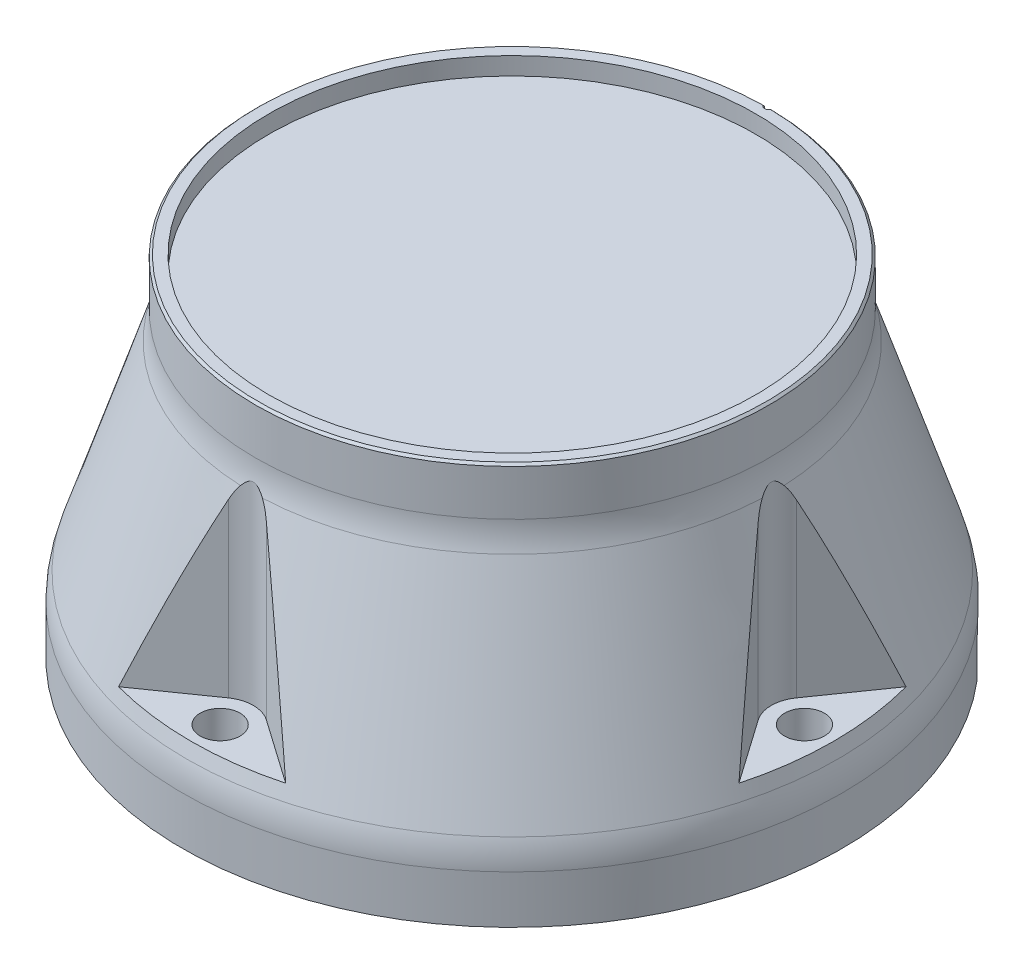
ISO-10303-21;
HEADER;
FILE_DESCRIPTION(('STEP AP214'),'2;1');
FILE_NAME('part.step','',(''),(''),'','','');
FILE_SCHEMA(('AUTOMOTIVE_DESIGN { 1 0 10303 214 1 1 1 1 }'));
ENDSEC;
DATA;
#1=APPLICATION_CONTEXT('core data for automotive mechanical design processes');
#2=APPLICATION_PROTOCOL_DEFINITION('international standard','automotive_design',2000,#1);
#3=PRODUCT_CONTEXT('',#1,'mechanical');
#4=PRODUCT('Part','Part','',(#3));
#5=PRODUCT_RELATED_PRODUCT_CATEGORY('part','',(#4));
#6=PRODUCT_DEFINITION_FORMATION('','',#4);
#7=PRODUCT_DEFINITION_CONTEXT('part definition',#1,'design');
#8=PRODUCT_DEFINITION('design','',#6,#7);
#9=PRODUCT_DEFINITION_SHAPE('','',#8);
#10=(LENGTH_UNIT() NAMED_UNIT(*) SI_UNIT(.MILLI.,.METRE.));
#11=(NAMED_UNIT(*) PLANE_ANGLE_UNIT() SI_UNIT($,.RADIAN.));
#12=(NAMED_UNIT(*) SI_UNIT($,.STERADIAN.) SOLID_ANGLE_UNIT());
#13=UNCERTAINTY_MEASURE_WITH_UNIT(LENGTH_MEASURE(1.E-05),#10,'distance_accuracy_value','');
#14=(GEOMETRIC_REPRESENTATION_CONTEXT(3) GLOBAL_UNCERTAINTY_ASSIGNED_CONTEXT((#13)) GLOBAL_UNIT_ASSIGNED_CONTEXT((#10,
#11,#12)) REPRESENTATION_CONTEXT('',''));
#15=CARTESIAN_POINT('',(0.,0.,0.));
#16=DIRECTION('',(0.,0.,1.));
#17=DIRECTION('',(1.,0.,0.));
#18=AXIS2_PLACEMENT_3D('',#15,#16,#17);
#19=CARTESIAN_POINT('',(0.,100.390423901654,0.));
#20=DIRECTION('',(0.,1.,0.));
#21=DIRECTION('',(0.,0.,1.));
#22=AXIS2_PLACEMENT_3D('',#19,#20,#21);
#23=CYLINDRICAL_SURFACE('',#22,58.);
#24=CARTESIAN_POINT('',(0.,68.1547941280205,0.));
#25=DIRECTION('',(0.,1.,0.));
#26=DIRECTION('',(0.,0.,1.));
#27=AXIS2_PLACEMENT_3D('',#24,#25,#26);
#28=CIRCLE('',#27,58.);
#29=CARTESIAN_POINT('',(0.,68.1547941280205,58.));
#30=VERTEX_POINT('',#29);
#31=EDGE_CURVE('E624',#30,#30,#28,.T.);
#32=ORIENTED_EDGE('',*,*,#31,.T.);
#33=EDGE_LOOP('',(#32));
#34=FACE_BOUND('',#33,.T.);
#35=DIRECTION('',(0.,1.,0.));
#36=VECTOR('',#35,1.);
#37=CARTESIAN_POINT('',(0.999962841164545,77.5,-57.9913793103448));
#38=LINE('',#37,#36);
#39=CARTESIAN_POINT('',(0.999962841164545,78.5000000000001,-57.9913793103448));
#40=VERTEX_POINT('',#39);
#41=CARTESIAN_POINT('',(0.999962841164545,76.,-57.9913793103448));
#42=VERTEX_POINT('',#41);
#43=EDGE_CURVE('E627',#40,#42,#38,.F.);
#44=ORIENTED_EDGE('',*,*,#43,.F.);
#45=CARTESIAN_POINT('',(0.,78.5000000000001,0.));
#46=DIRECTION('',(0.,1.,0.));
#47=DIRECTION('',(0.,0.,1.));
#48=AXIS2_PLACEMENT_3D('',#45,#46,#47);
#49=CIRCLE('',#48,58.);
#50=CARTESIAN_POINT('',(-0.999962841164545,78.5000000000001,-57.9913793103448));
#51=VERTEX_POINT('',#50);
#52=EDGE_CURVE('E603',#40,#51,#49,.F.);
#53=ORIENTED_EDGE('',*,*,#52,.T.);
#54=DIRECTION('',(0.,1.,0.));
#55=VECTOR('',#54,1.);
#56=CARTESIAN_POINT('',(-0.999962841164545,77.5,-57.9913793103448));
#57=LINE('',#56,#55);
#58=CARTESIAN_POINT('',(-0.999962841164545,76.,-57.9913793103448));
#59=VERTEX_POINT('',#58);
#60=EDGE_CURVE('E633',#59,#51,#57,.T.);
#61=ORIENTED_EDGE('',*,*,#60,.F.);
#62=CARTESIAN_POINT('',(0.,76.,0.));
#63=DIRECTION('',(0.,1.,0.));
#64=DIRECTION('',(0.,0.,1.));
#65=AXIS2_PLACEMENT_3D('',#62,#63,#64);
#66=CIRCLE('',#65,58.);
#67=EDGE_CURVE('E630',#59,#42,#66,.F.);
#68=ORIENTED_EDGE('',*,*,#67,.T.);
#69=EDGE_LOOP('',(#44,#53,#61,#68));
#70=FACE_BOUND('',#69,.T.);
#71=ADVANCED_FACE('F36',(#34,#70),#23,.T.);
#72=CARTESIAN_POINT('',(0.,65.,0.));
#73=DIRECTION('',(0.,-1.,0.));
#74=DIRECTION('',(0.,0.,-1.));
#75=AXIS2_PLACEMENT_3D('',#72,#73,#74);
#76=CONICAL_SURFACE('',#75,58.,0.312901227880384);
#77=CARTESIAN_POINT('',(0.,17.0016115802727,0.));
#78=DIRECTION('',(0.,1.,0.));
#79=DIRECTION('',(0.,0.,1.));
#80=AXIS2_PLACEMENT_3D('',#77,#78,#79);
#81=CIRCLE('',#80,73.5288903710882);
#82=CARTESIAN_POINT('',(0.,17.0016115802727,73.5288903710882));
#83=VERTEX_POINT('',#82);
#84=EDGE_CURVE('E1312',#83,#83,#81,.T.);
#85=ORIENTED_EDGE('',*,*,#84,.T.);
#86=EDGE_LOOP('',(#85));
#87=FACE_BOUND('',#86,.T.);
#88=CARTESIAN_POINT('',(-59.8564997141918,58.784494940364,4.30202327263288));
#89=CARTESIAN_POINT('',(-59.8146719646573,58.9266833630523,4.2422840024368));
#90=CARTESIAN_POINT('',(-59.7730641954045,59.0682877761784,4.18102149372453));
#91=CARTESIAN_POINT('',(-59.6903400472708,59.3501441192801,4.05510422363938));
#92=CARTESIAN_POINT('',(-59.6492237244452,59.4903958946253,3.99044907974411));
#93=CARTESIAN_POINT('',(-59.5271039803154,59.9074288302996,3.79154938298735));
#94=CARTESIAN_POINT('',(-59.4469181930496,60.1818869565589,3.65179073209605));
#95=CARTESIAN_POINT('',(-59.328890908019,60.5867453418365,3.42831813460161));
#96=CARTESIAN_POINT('',(-59.2899053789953,60.720623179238,3.35148093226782));
#97=CARTESIAN_POINT('',(-59.2128609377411,60.9854804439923,3.19257613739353));
#98=CARTESIAN_POINT('',(-59.1748018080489,61.1164605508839,3.11050978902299));
#99=CARTESIAN_POINT('',(-59.0996244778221,61.375453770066,2.93999653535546));
#100=CARTESIAN_POINT('',(-59.0625115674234,61.5034499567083,2.85152133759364));
#101=CARTESIAN_POINT('',(-58.9897025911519,61.7548094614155,2.6674704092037));
#102=CARTESIAN_POINT('',(-58.9540077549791,61.8781687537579,2.57188871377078));
#103=CARTESIAN_POINT('',(-58.9191980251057,61.9985884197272,2.47229516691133));
#104=B_SPLINE_CURVE_WITH_KNOTS('',3,(#88,#89,#90,#91,#92,#93,#94,#95,#96,#97,#98,#99,#100,#101,
#102,#103),.UNSPECIFIED.,.F.,.F.,(4,2,2,2,2,2,2,4),(0.,0.47936953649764,0.958793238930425,
1.9129359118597,2.39046998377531,2.86789085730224,3.34756554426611,3.827647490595),.UNSPECIFIED.);
#105=CARTESIAN_POINT('',(-59.8563596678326,58.7849710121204,4.30182327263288));
#106=VERTEX_POINT('',#105);
#107=CARTESIAN_POINT('',(-58.9192558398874,61.9983884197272,2.47246074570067));
#108=VERTEX_POINT('',#107);
#109=EDGE_CURVE('E1273',#106,#108,#104,.T.);
#110=ORIENTED_EDGE('',*,*,#109,.F.);
#111=CARTESIAN_POINT('',(-70.060802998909,19.9998,18.8752786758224));
#112=CARTESIAN_POINT('',(-69.6642759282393,21.6384852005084,18.3089793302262));
#113=CARTESIAN_POINT('',(-69.2651982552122,23.2753032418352,17.7390373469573));
#114=CARTESIAN_POINT('',(-68.4612934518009,26.5446593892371,16.5909423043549));
#115=CARTESIAN_POINT('',(-68.0564662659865,28.1771974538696,16.0127891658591));
#116=CARTESIAN_POINT('',(-67.2405571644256,31.436875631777,14.8475502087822));
#117=CARTESIAN_POINT('',(-66.8294773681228,33.0640173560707,14.2604674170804));
#118=CARTESIAN_POINT('',(-66.0001457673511,36.312743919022,13.07605914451));
#119=CARTESIAN_POINT('',(-65.5818939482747,37.9343287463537,12.4787336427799));
#120=CARTESIAN_POINT('',(-64.7372473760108,41.1712717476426,11.2724533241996));
#121=CARTESIAN_POINT('',(-64.310851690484,42.7866291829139,10.6634971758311));
#122=CARTESIAN_POINT('',(-63.4488624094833,46.0098474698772,9.43244890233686));
#123=CARTESIAN_POINT('',(-63.0132689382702,47.6177084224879,8.810356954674));
#124=CARTESIAN_POINT('',(-62.1313964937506,50.825158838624,7.55091258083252));
#125=CARTESIAN_POINT('',(-61.6851141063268,52.4247454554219,6.91355527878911));
#126=CARTESIAN_POINT('',(-61.0065336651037,54.8162705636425,5.94444197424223));
#127=CARTESIAN_POINT('',(-60.7788081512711,55.6121565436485,5.6192162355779));
#128=CARTESIAN_POINT('',(-60.3200539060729,57.2010379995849,4.96404727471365));
#129=CARTESIAN_POINT('',(-60.0890251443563,57.9940334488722,4.63410400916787));
#130=CARTESIAN_POINT('',(-59.8562196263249,58.785447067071,4.30162327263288));
#131=B_SPLINE_CURVE_WITH_KNOTS('',3,(#111,#112,#113,#114,#115,#116,#117,#118,#119,#120,#121,
#122,#123,#124,#125,#126,#127,#128,#129,#130),.UNSPECIFIED.,.F.,.F.,(4,2,2,2,2,2,2,2,2,4),(0.,
5.33563680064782,10.6713250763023,16.0052433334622,21.3391724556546,26.6737159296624,
32.0081873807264,37.3443860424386,40.0126206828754,42.6808798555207),.UNSPECIFIED.);
#132=CARTESIAN_POINT('',(-70.0607546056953,20.,18.8752095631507));
#133=VERTEX_POINT('',#132);
#134=EDGE_CURVE('E1295',#133,#106,#131,.T.);
#135=ORIENTED_EDGE('',*,*,#134,.F.);
#136=CARTESIAN_POINT('',(0.,20.,0.));
#137=DIRECTION('',(0.,-1.,0.));
#138=DIRECTION('',(0.,0.,-1.));
#139=AXIS2_PLACEMENT_3D('',#136,#137,#138);
#140=CIRCLE('',#139,72.5588235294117);
#141=CARTESIAN_POINT('',(-70.0607546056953,20.,-18.8752095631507));
#142=VERTEX_POINT('',#141);
#143=EDGE_CURVE('E396',#142,#133,#140,.F.);
#144=ORIENTED_EDGE('',*,*,#143,.F.);
#145=CARTESIAN_POINT('',(-59.8562196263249,58.785447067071,-4.30162327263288));
#146=CARTESIAN_POINT('',(-60.0890251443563,57.9940334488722,-4.63410400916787));
#147=CARTESIAN_POINT('',(-60.3200539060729,57.2010379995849,-4.96404727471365));
#148=CARTESIAN_POINT('',(-60.7788081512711,55.6121565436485,-5.6192162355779));
#149=CARTESIAN_POINT('',(-61.0065336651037,54.8162705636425,-5.94444197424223));
#150=CARTESIAN_POINT('',(-61.6851141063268,52.424745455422,-6.91355527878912));
#151=CARTESIAN_POINT('',(-62.1313964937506,50.8251588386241,-7.55091258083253));
#152=CARTESIAN_POINT('',(-63.0132689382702,47.617708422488,-8.81035695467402));
#153=CARTESIAN_POINT('',(-63.4488624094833,46.0098474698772,-9.43244890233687));
#154=CARTESIAN_POINT('',(-64.310851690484,42.7866291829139,-10.6634971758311));
#155=CARTESIAN_POINT('',(-64.7372473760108,41.1712717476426,-11.2724533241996));
#156=CARTESIAN_POINT('',(-65.5818939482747,37.9343287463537,-12.4787336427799));
#157=CARTESIAN_POINT('',(-66.0001457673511,36.312743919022,-13.0760591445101));
#158=CARTESIAN_POINT('',(-66.8294773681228,33.0640173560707,-14.2604674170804));
#159=CARTESIAN_POINT('',(-67.2405571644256,31.436875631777,-14.8475502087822));
#160=CARTESIAN_POINT('',(-68.0564662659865,28.1771974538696,-16.0127891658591));
#161=CARTESIAN_POINT('',(-68.4612934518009,26.5446593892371,-16.5909423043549));
#162=CARTESIAN_POINT('',(-69.2651982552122,23.2753032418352,-17.7390373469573));
#163=CARTESIAN_POINT('',(-69.6642759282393,21.6384852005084,-18.3089793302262));
#164=CARTESIAN_POINT('',(-70.060802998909,19.9998,-18.8752786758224));
#165=B_SPLINE_CURVE_WITH_KNOTS('',3,(#145,#146,#147,#148,#149,#150,#151,#152,#153,#154,#155,
#156,#157,#158,#159,#160,#161,#162,#163,#164),.UNSPECIFIED.,.F.,.F.,(4,2,2,2,2,2,2,2,2,4),(0.,
2.6682591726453,5.33649381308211,10.6726924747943,16.0071639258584,21.3417073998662,
26.6756365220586,32.0095547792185,37.3452430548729,42.6808798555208),.UNSPECIFIED.);
#166=CARTESIAN_POINT('',(-59.8563596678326,58.7849710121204,-4.30182327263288));
#167=VERTEX_POINT('',#166);
#168=EDGE_CURVE('E1306',#167,#142,#165,.T.);
#169=ORIENTED_EDGE('',*,*,#168,.F.);
#170=CARTESIAN_POINT('',(-58.9191980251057,61.9985884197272,-2.47229516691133));
#171=CARTESIAN_POINT('',(-58.9540077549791,61.8781687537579,-2.57188871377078));
#172=CARTESIAN_POINT('',(-58.9897025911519,61.7548094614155,-2.6674704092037));
#173=CARTESIAN_POINT('',(-59.0625115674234,61.5034499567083,-2.85152133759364));
#174=CARTESIAN_POINT('',(-59.0996244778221,61.375453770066,-2.93999653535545));
#175=CARTESIAN_POINT('',(-59.1748018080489,61.1164605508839,-3.11050978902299));
#176=CARTESIAN_POINT('',(-59.2128609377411,60.9854804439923,-3.19257613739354));
#177=CARTESIAN_POINT('',(-59.2899053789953,60.720623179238,-3.35148093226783));
#178=CARTESIAN_POINT('',(-59.328890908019,60.5867453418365,-3.42831813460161));
#179=CARTESIAN_POINT('',(-59.4469181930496,60.1818869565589,-3.65179073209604));
#180=CARTESIAN_POINT('',(-59.5271039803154,59.9074288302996,-3.79154938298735));
#181=CARTESIAN_POINT('',(-59.6492237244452,59.4903958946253,-3.99044907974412));
#182=CARTESIAN_POINT('',(-59.6903400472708,59.3501441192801,-4.05510422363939));
#183=CARTESIAN_POINT('',(-59.7730641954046,59.0682877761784,-4.18102149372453));
#184=CARTESIAN_POINT('',(-59.8146719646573,58.9266833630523,-4.2422840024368));
#185=CARTESIAN_POINT('',(-59.8564997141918,58.784494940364,-4.30202327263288));
#186=B_SPLINE_CURVE_WITH_KNOTS('',3,(#170,#171,#172,#173,#174,#175,#176,#177,#178,#179,#180,
#181,#182,#183,#184,#185),.UNSPECIFIED.,.F.,.F.,(4,2,2,2,2,2,2,4),(0.,0.480081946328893,
0.959756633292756,1.43717750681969,1.9147115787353,2.86885425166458,3.34827795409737,
3.82764749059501),.UNSPECIFIED.);
#187=CARTESIAN_POINT('',(-58.9192558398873,61.9983884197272,-2.47246074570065));
#188=VERTEX_POINT('',#187);
#189=EDGE_CURVE('E1278',#188,#167,#186,.T.);
#190=ORIENTED_EDGE('',*,*,#189,.F.);
#191=CARTESIAN_POINT('',(0.,61.9983884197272,0.));
#192=DIRECTION('',(0.,-1.,0.));
#193=DIRECTION('',(0.,0.,-1.));
#194=AXIS2_PLACEMENT_3D('',#191,#192,#193);
#195=CIRCLE('',#194,58.9711096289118);
#196=CARTESIAN_POINT('',(-2.47246074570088,61.9983884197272,-58.9192558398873));
#197=VERTEX_POINT('',#196);
#198=EDGE_CURVE('E681',#188,#197,#195,.T.);
#199=ORIENTED_EDGE('',*,*,#198,.T.);
#200=CARTESIAN_POINT('',(-4.30202327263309,58.784494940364,-59.8564997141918));
#201=CARTESIAN_POINT('',(-4.24228400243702,58.9266833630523,-59.8146719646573));
#202=CARTESIAN_POINT('',(-4.18102149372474,59.0682877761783,-59.7730641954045));
#203=CARTESIAN_POINT('',(-4.0551042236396,59.3501441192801,-59.6903400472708));
#204=CARTESIAN_POINT('',(-3.99044907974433,59.4903958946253,-59.6492237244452));
#205=CARTESIAN_POINT('',(-3.79154938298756,59.9074288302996,-59.5271039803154));
#206=CARTESIAN_POINT('',(-3.65179073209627,60.1818869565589,-59.4469181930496));
#207=CARTESIAN_POINT('',(-3.42831813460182,60.5867453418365,-59.328890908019));
#208=CARTESIAN_POINT('',(-3.35148093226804,60.720623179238,-59.2899053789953));
#209=CARTESIAN_POINT('',(-3.19257613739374,60.9854804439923,-59.2128609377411));
#210=CARTESIAN_POINT('',(-3.11050978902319,61.1164605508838,-59.1748018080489));
#211=CARTESIAN_POINT('',(-2.93999653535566,61.375453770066,-59.0996244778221));
#212=CARTESIAN_POINT('',(-2.85152133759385,61.5034499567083,-59.0625115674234));
#213=CARTESIAN_POINT('',(-2.66747040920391,61.7548094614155,-58.9897025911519));
#214=CARTESIAN_POINT('',(-2.57188871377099,61.8781687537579,-58.9540077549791));
#215=CARTESIAN_POINT('',(-2.47229516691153,61.9985884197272,-58.9191980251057));
#216=B_SPLINE_CURVE_WITH_KNOTS('',3,(#200,#201,#202,#203,#204,#205,#206,#207,#208,#209,#210,
#211,#212,#213,#214,#215),.UNSPECIFIED.,.F.,.F.,(4,2,2,2,2,2,2,4),(0.,0.479369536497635,
0.958793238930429,1.91293591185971,2.39046998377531,2.86789085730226,3.34756554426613,
3.82764749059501),.UNSPECIFIED.);
#217=CARTESIAN_POINT('',(-4.30182327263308,58.7849710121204,-59.8563596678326));
#218=VERTEX_POINT('',#217);
#219=EDGE_CURVE('E509',#218,#197,#216,.T.);
#220=ORIENTED_EDGE('',*,*,#219,.F.);
#221=CARTESIAN_POINT('',(-18.8752786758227,19.9998,-70.060802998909));
#222=CARTESIAN_POINT('',(-18.3089793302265,21.6384852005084,-69.6642759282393));
#223=CARTESIAN_POINT('',(-17.7390373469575,23.2753032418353,-69.2651982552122));
#224=CARTESIAN_POINT('',(-16.5909423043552,26.5446593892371,-68.4612934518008));
#225=CARTESIAN_POINT('',(-16.0127891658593,28.1771974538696,-68.0564662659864));
#226=CARTESIAN_POINT('',(-14.8475502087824,31.436875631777,-67.2405571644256));
#227=CARTESIAN_POINT('',(-14.2604674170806,33.0640173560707,-66.8294773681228));
#228=CARTESIAN_POINT('',(-13.0760591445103,36.312743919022,-66.0001457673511));
#229=CARTESIAN_POINT('',(-12.4787336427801,37.9343287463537,-65.5818939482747));
#230=CARTESIAN_POINT('',(-11.2724533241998,41.1712717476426,-64.7372473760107));
#231=CARTESIAN_POINT('',(-10.6634971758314,42.7866291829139,-64.310851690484));
#232=CARTESIAN_POINT('',(-9.43244890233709,46.0098474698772,-63.4488624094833));
#233=CARTESIAN_POINT('',(-8.81035695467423,47.6177084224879,-63.0132689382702));
#234=CARTESIAN_POINT('',(-7.55091258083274,50.825158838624,-62.1313964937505));
#235=CARTESIAN_POINT('',(-6.91355527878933,52.4247454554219,-61.6851141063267));
#236=CARTESIAN_POINT('',(-5.94444197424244,54.8162705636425,-61.0065336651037));
#237=CARTESIAN_POINT('',(-5.61921623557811,55.6121565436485,-60.7788081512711));
#238=CARTESIAN_POINT('',(-4.96404727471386,57.2010379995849,-60.3200539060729));
#239=CARTESIAN_POINT('',(-4.63410400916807,57.9940334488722,-60.0890251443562));
#240=CARTESIAN_POINT('',(-4.30162327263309,58.785447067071,-59.8562196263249));
#241=B_SPLINE_CURVE_WITH_KNOTS('',3,(#221,#222,#223,#224,#225,#226,#227,#228,#229,#230,#231,
#232,#233,#234,#235,#236,#237,#238,#239,#240),.UNSPECIFIED.,.F.,.F.,(4,2,2,2,2,2,2,2,2,4),(0.,
5.33563680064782,10.6713250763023,16.0052433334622,21.3391724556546,26.6737159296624,
32.0081873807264,37.3443860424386,40.0126206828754,42.6808798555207),.UNSPECIFIED.);
#242=CARTESIAN_POINT('',(-18.875209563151,20.,-70.0607546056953));
#243=VERTEX_POINT('',#242);
#244=EDGE_CURVE('E485',#243,#218,#241,.T.);
#245=ORIENTED_EDGE('',*,*,#244,.F.);
#246=CARTESIAN_POINT('',(0.,20.,0.));
#247=DIRECTION('',(0.,-1.,0.));
#248=DIRECTION('',(0.,0.,-1.));
#249=AXIS2_PLACEMENT_3D('',#246,#247,#248);
#250=CIRCLE('',#249,72.5588235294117);
#251=CARTESIAN_POINT('',(18.8752095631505,20.,-70.0607546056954));
#252=VERTEX_POINT('',#251);
#253=EDGE_CURVE('E517',#252,#243,#250,.F.);
#254=ORIENTED_EDGE('',*,*,#253,.F.);
#255=CARTESIAN_POINT('',(4.30162327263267,58.7854470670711,-59.856219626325));
#256=CARTESIAN_POINT('',(4.63410400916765,57.9940334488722,-60.0890251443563));
#257=CARTESIAN_POINT('',(4.96404727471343,57.2010379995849,-60.3200539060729));
#258=CARTESIAN_POINT('',(5.61921623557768,55.6121565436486,-60.7788081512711));
#259=CARTESIAN_POINT('',(5.94444197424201,54.8162705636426,-61.0065336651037));
#260=CARTESIAN_POINT('',(6.9135552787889,52.424745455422,-61.6851141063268));
#261=CARTESIAN_POINT('',(7.55091258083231,50.8251588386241,-62.1313964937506));
#262=CARTESIAN_POINT('',(8.81035695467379,47.617708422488,-63.0132689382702));
#263=CARTESIAN_POINT('',(9.43244890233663,46.0098474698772,-63.4488624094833));
#264=CARTESIAN_POINT('',(10.6634971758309,42.7866291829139,-64.3108516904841));
#265=CARTESIAN_POINT('',(11.2724533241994,41.1712717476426,-64.7372473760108));
#266=CARTESIAN_POINT('',(12.4787336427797,37.9343287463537,-65.5818939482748));
#267=CARTESIAN_POINT('',(13.0760591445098,36.312743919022,-66.0001457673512));
#268=CARTESIAN_POINT('',(14.2604674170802,33.0640173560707,-66.8294773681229));
#269=CARTESIAN_POINT('',(14.847550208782,31.436875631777,-67.2405571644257));
#270=CARTESIAN_POINT('',(16.0127891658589,28.1771974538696,-68.0564662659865));
#271=CARTESIAN_POINT('',(16.5909423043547,26.5446593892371,-68.4612934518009));
#272=CARTESIAN_POINT('',(17.739037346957,23.2753032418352,-69.2651982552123));
#273=CARTESIAN_POINT('',(18.308979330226,21.6384852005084,-69.6642759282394));
#274=CARTESIAN_POINT('',(18.8752786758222,19.9998,-70.0608029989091));
#275=B_SPLINE_CURVE_WITH_KNOTS('',3,(#255,#256,#257,#258,#259,#260,#261,#262,#263,#264,#265,
#266,#267,#268,#269,#270,#271,#272,#273,#274),.UNSPECIFIED.,.F.,.F.,(4,2,2,2,2,2,2,2,2,4),(0.,
2.66825917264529,5.33649381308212,10.6726924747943,16.0071639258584,21.3417073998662,
26.6756365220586,32.0095547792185,37.345243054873,42.6808798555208),.UNSPECIFIED.);
#276=CARTESIAN_POINT('',(4.30182327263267,58.7849710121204,-59.8563596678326));
#277=VERTEX_POINT('',#276);
#278=EDGE_CURVE('E445',#277,#252,#275,.T.);
#279=ORIENTED_EDGE('',*,*,#278,.F.);
#280=CARTESIAN_POINT('',(2.47229516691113,61.9985884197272,-58.9191980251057));
#281=CARTESIAN_POINT('',(2.57188871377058,61.8781687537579,-58.9540077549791));
#282=CARTESIAN_POINT('',(2.6674704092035,61.7548094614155,-58.9897025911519));
#283=CARTESIAN_POINT('',(2.85152133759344,61.5034499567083,-59.0625115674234));
#284=CARTESIAN_POINT('',(2.93999653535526,61.375453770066,-59.0996244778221));
#285=CARTESIAN_POINT('',(3.11050978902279,61.1164605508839,-59.1748018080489));
#286=CARTESIAN_POINT('',(3.19257613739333,60.9854804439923,-59.2128609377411));
#287=CARTESIAN_POINT('',(3.35148093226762,60.720623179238,-59.2899053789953));
#288=CARTESIAN_POINT('',(3.42831813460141,60.5867453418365,-59.328890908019));
#289=CARTESIAN_POINT('',(3.65179073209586,60.1818869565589,-59.4469181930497));
#290=CARTESIAN_POINT('',(3.79154938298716,59.9074288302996,-59.5271039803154));
#291=CARTESIAN_POINT('',(3.99044907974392,59.4903958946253,-59.6492237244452));
#292=CARTESIAN_POINT('',(4.05510422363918,59.3501441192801,-59.6903400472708));
#293=CARTESIAN_POINT('',(4.18102149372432,59.0682877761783,-59.7730641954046));
#294=CARTESIAN_POINT('',(4.24228400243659,58.9266833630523,-59.8146719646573));
#295=CARTESIAN_POINT('',(4.30202327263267,58.7844949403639,-59.8564997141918));
#296=B_SPLINE_CURVE_WITH_KNOTS('',3,(#280,#281,#282,#283,#284,#285,#286,#287,#288,#289,#290,
#291,#292,#293,#294,#295),.UNSPECIFIED.,.F.,.F.,(4,2,2,2,2,2,2,4),(0.,0.48008194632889,
0.95975663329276,1.43717750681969,1.9147115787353,2.86885425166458,3.34827795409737,
3.82764749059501),.UNSPECIFIED.);
#297=CARTESIAN_POINT('',(2.47246074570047,61.9983884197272,-58.9192558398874));
#298=VERTEX_POINT('',#297);
#299=EDGE_CURVE('E516',#298,#277,#296,.T.);
#300=ORIENTED_EDGE('',*,*,#299,.F.);
#301=CARTESIAN_POINT('',(58.9192558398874,61.9983884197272,-2.47246074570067));
#302=VERTEX_POINT('',#301);
#303=EDGE_CURVE('E675',#298,#302,#195,.T.);
#304=ORIENTED_EDGE('',*,*,#303,.T.);
#305=CARTESIAN_POINT('',(59.8564997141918,58.784494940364,-4.30202327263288));
#306=CARTESIAN_POINT('',(59.8146719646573,58.9266833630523,-4.2422840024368));
#307=CARTESIAN_POINT('',(59.7730641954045,59.0682877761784,-4.18102149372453));
#308=CARTESIAN_POINT('',(59.6903400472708,59.3501441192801,-4.05510422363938));
#309=CARTESIAN_POINT('',(59.6492237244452,59.4903958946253,-3.99044907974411));
#310=CARTESIAN_POINT('',(59.5271039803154,59.9074288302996,-3.79154938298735));
#311=CARTESIAN_POINT('',(59.4469181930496,60.1818869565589,-3.65179073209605));
#312=CARTESIAN_POINT('',(59.328890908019,60.5867453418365,-3.42831813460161));
#313=CARTESIAN_POINT('',(59.2899053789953,60.720623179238,-3.35148093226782));
#314=CARTESIAN_POINT('',(59.2128609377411,60.9854804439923,-3.19257613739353));
#315=CARTESIAN_POINT('',(59.1748018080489,61.1164605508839,-3.11050978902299));
#316=CARTESIAN_POINT('',(59.0996244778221,61.375453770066,-2.93999653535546));
#317=CARTESIAN_POINT('',(59.0625115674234,61.5034499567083,-2.85152133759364));
#318=CARTESIAN_POINT('',(58.9897025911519,61.7548094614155,-2.6674704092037));
#319=CARTESIAN_POINT('',(58.9540077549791,61.8781687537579,-2.57188871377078));
#320=CARTESIAN_POINT('',(58.9191980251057,61.9985884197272,-2.47229516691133));
#321=B_SPLINE_CURVE_WITH_KNOTS('',3,(#305,#306,#307,#308,#309,#310,#311,#312,#313,#314,#315,
#316,#317,#318,#319,#320),.UNSPECIFIED.,.F.,.F.,(4,2,2,2,2,2,2,4),(0.,0.47936953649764,
0.958793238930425,1.9129359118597,2.39046998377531,2.86789085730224,3.34756554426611,
3.827647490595),.UNSPECIFIED.);
#322=CARTESIAN_POINT('',(59.8563596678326,58.7849710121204,-4.30182327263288));
#323=VERTEX_POINT('',#322);
#324=EDGE_CURVE('E555',#323,#302,#321,.T.);
#325=ORIENTED_EDGE('',*,*,#324,.F.);
#326=CARTESIAN_POINT('',(70.060802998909,19.9998,-18.8752786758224));
#327=CARTESIAN_POINT('',(69.6642759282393,21.6384852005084,-18.3089793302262));
#328=CARTESIAN_POINT('',(69.2651982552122,23.2753032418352,-17.7390373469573));
#329=CARTESIAN_POINT('',(68.4612934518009,26.5446593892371,-16.5909423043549));
#330=CARTESIAN_POINT('',(68.0564662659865,28.1771974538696,-16.0127891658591));
#331=CARTESIAN_POINT('',(67.2405571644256,31.436875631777,-14.8475502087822));
#332=CARTESIAN_POINT('',(66.8294773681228,33.0640173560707,-14.2604674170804));
#333=CARTESIAN_POINT('',(66.0001457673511,36.312743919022,-13.07605914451));
#334=CARTESIAN_POINT('',(65.5818939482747,37.9343287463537,-12.4787336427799));
#335=CARTESIAN_POINT('',(64.7372473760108,41.1712717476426,-11.2724533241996));
#336=CARTESIAN_POINT('',(64.310851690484,42.7866291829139,-10.6634971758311));
#337=CARTESIAN_POINT('',(63.4488624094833,46.0098474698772,-9.43244890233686));
#338=CARTESIAN_POINT('',(63.0132689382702,47.6177084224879,-8.810356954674));
#339=CARTESIAN_POINT('',(62.1313964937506,50.825158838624,-7.55091258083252));
#340=CARTESIAN_POINT('',(61.6851141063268,52.4247454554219,-6.91355527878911));
#341=CARTESIAN_POINT('',(61.0065336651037,54.8162705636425,-5.94444197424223));
#342=CARTESIAN_POINT('',(60.7788081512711,55.6121565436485,-5.6192162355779));
#343=CARTESIAN_POINT('',(60.3200539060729,57.2010379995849,-4.96404727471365));
#344=CARTESIAN_POINT('',(60.0890251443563,57.9940334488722,-4.63410400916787));
#345=CARTESIAN_POINT('',(59.8562196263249,58.785447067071,-4.30162327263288));
#346=B_SPLINE_CURVE_WITH_KNOTS('',3,(#326,#327,#328,#329,#330,#331,#332,#333,#334,#335,#336,
#337,#338,#339,#340,#341,#342,#343,#344,#345),.UNSPECIFIED.,.F.,.F.,(4,2,2,2,2,2,2,2,2,4),(0.,
5.33563680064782,10.6713250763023,16.0052433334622,21.3391724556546,26.6737159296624,
32.0081873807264,37.3443860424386,40.0126206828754,42.6808798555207),.UNSPECIFIED.);
#347=CARTESIAN_POINT('',(70.0607546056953,20.,-18.8752095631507));
#348=VERTEX_POINT('',#347);
#349=EDGE_CURVE('E1463',#348,#323,#346,.T.);
#350=ORIENTED_EDGE('',*,*,#349,.F.);
#351=CARTESIAN_POINT('',(0.,20.,0.));
#352=DIRECTION('',(0.,-1.,0.));
#353=DIRECTION('',(0.,0.,-1.));
#354=AXIS2_PLACEMENT_3D('',#351,#352,#353);
#355=CIRCLE('',#354,72.5588235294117);
#356=CARTESIAN_POINT('',(70.0607546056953,20.,18.8752095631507));
#357=VERTEX_POINT('',#356);
#358=EDGE_CURVE('E547',#357,#348,#355,.F.);
#359=ORIENTED_EDGE('',*,*,#358,.F.);
#360=CARTESIAN_POINT('',(59.8562196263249,58.785447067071,4.30162327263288));
#361=CARTESIAN_POINT('',(60.0890251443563,57.9940334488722,4.63410400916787));
#362=CARTESIAN_POINT('',(60.3200539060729,57.2010379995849,4.96404727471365));
#363=CARTESIAN_POINT('',(60.7788081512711,55.6121565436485,5.6192162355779));
#364=CARTESIAN_POINT('',(61.0065336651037,54.8162705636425,5.94444197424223));
#365=CARTESIAN_POINT('',(61.6851141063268,52.424745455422,6.91355527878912));
#366=CARTESIAN_POINT('',(62.1313964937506,50.8251588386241,7.55091258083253));
#367=CARTESIAN_POINT('',(63.0132689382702,47.617708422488,8.81035695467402));
#368=CARTESIAN_POINT('',(63.4488624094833,46.0098474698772,9.43244890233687));
#369=CARTESIAN_POINT('',(64.310851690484,42.7866291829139,10.6634971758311));
#370=CARTESIAN_POINT('',(64.7372473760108,41.1712717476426,11.2724533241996));
#371=CARTESIAN_POINT('',(65.5818939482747,37.9343287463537,12.4787336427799));
#372=CARTESIAN_POINT('',(66.0001457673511,36.312743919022,13.0760591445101));
#373=CARTESIAN_POINT('',(66.8294773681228,33.0640173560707,14.2604674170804));
#374=CARTESIAN_POINT('',(67.2405571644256,31.436875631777,14.8475502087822));
#375=CARTESIAN_POINT('',(68.0564662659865,28.1771974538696,16.0127891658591));
#376=CARTESIAN_POINT('',(68.4612934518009,26.5446593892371,16.5909423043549));
#377=CARTESIAN_POINT('',(69.2651982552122,23.2753032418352,17.7390373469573));
#378=CARTESIAN_POINT('',(69.6642759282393,21.6384852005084,18.3089793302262));
#379=CARTESIAN_POINT('',(70.060802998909,19.9998,18.8752786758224));
#380=B_SPLINE_CURVE_WITH_KNOTS('',3,(#360,#361,#362,#363,#364,#365,#366,#367,#368,#369,#370,
#371,#372,#373,#374,#375,#376,#377,#378,#379),.UNSPECIFIED.,.F.,.F.,(4,2,2,2,2,2,2,2,2,4),(0.,
2.6682591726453,5.33649381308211,10.6726924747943,16.0071639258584,21.3417073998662,
26.6756365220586,32.0095547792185,37.3452430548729,42.6808798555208),.UNSPECIFIED.);
#381=CARTESIAN_POINT('',(59.8563596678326,58.7849710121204,4.30182327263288));
#382=VERTEX_POINT('',#381);
#383=EDGE_CURVE('E486',#382,#357,#380,.T.);
#384=ORIENTED_EDGE('',*,*,#383,.F.);
#385=CARTESIAN_POINT('',(58.9191980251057,61.9985884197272,2.47229516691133));
#386=CARTESIAN_POINT('',(58.9540077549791,61.8781687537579,2.57188871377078));
#387=CARTESIAN_POINT('',(58.9897025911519,61.7548094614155,2.6674704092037));
#388=CARTESIAN_POINT('',(59.0625115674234,61.5034499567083,2.85152133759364));
#389=CARTESIAN_POINT('',(59.0996244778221,61.375453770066,2.93999653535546));
#390=CARTESIAN_POINT('',(59.1748018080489,61.1164605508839,3.11050978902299));
#391=CARTESIAN_POINT('',(59.2128609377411,60.9854804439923,3.19257613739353));
#392=CARTESIAN_POINT('',(59.2899053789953,60.720623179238,3.35148093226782));
#393=CARTESIAN_POINT('',(59.328890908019,60.5867453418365,3.42831813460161));
#394=CARTESIAN_POINT('',(59.4469181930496,60.1818869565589,3.65179073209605));
#395=CARTESIAN_POINT('',(59.5271039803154,59.9074288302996,3.79154938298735));
#396=CARTESIAN_POINT('',(59.6492237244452,59.4903958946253,3.99044907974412));
#397=CARTESIAN_POINT('',(59.6903400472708,59.3501441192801,4.05510422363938));
#398=CARTESIAN_POINT('',(59.7730641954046,59.0682877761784,4.18102149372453));
#399=CARTESIAN_POINT('',(59.8146719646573,58.9266833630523,4.24228400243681));
#400=CARTESIAN_POINT('',(59.8564997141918,58.784494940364,4.30202327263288));
#401=B_SPLINE_CURVE_WITH_KNOTS('',3,(#385,#386,#387,#388,#389,#390,#391,#392,#393,#394,#395,
#396,#397,#398,#399,#400),.UNSPECIFIED.,.F.,.F.,(4,2,2,2,2,2,2,4),(0.,0.480081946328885,
0.959756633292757,1.4371775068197,1.9147115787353,2.86885425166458,3.34827795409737,
3.82764749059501),.UNSPECIFIED.);
#402=CARTESIAN_POINT('',(58.9192558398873,61.9983884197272,2.47246074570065));
#403=VERTEX_POINT('',#402);
#404=EDGE_CURVE('E549',#403,#382,#401,.T.);
#405=ORIENTED_EDGE('',*,*,#404,.F.);
#406=CARTESIAN_POINT('',(2.47246074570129,61.9983884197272,58.9192558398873));
#407=VERTEX_POINT('',#406);
#408=EDGE_CURVE('E676',#403,#407,#195,.T.);
#409=ORIENTED_EDGE('',*,*,#408,.T.);
#410=CARTESIAN_POINT('',(4.3020232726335,58.784494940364,59.8564997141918));
#411=CARTESIAN_POINT('',(4.24228400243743,58.9266833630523,59.8146719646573));
#412=CARTESIAN_POINT('',(4.18102149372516,59.0682877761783,59.7730641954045));
#413=CARTESIAN_POINT('',(4.05510422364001,59.3501441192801,59.6903400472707));
#414=CARTESIAN_POINT('',(3.99044907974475,59.4903958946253,59.6492237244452));
#415=CARTESIAN_POINT('',(3.79154938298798,59.9074288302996,59.5271039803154));
#416=CARTESIAN_POINT('',(3.65179073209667,60.1818869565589,59.4469181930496));
#417=CARTESIAN_POINT('',(3.42831813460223,60.5867453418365,59.328890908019));
#418=CARTESIAN_POINT('',(3.35148093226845,60.7206231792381,59.2899053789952));
#419=CARTESIAN_POINT('',(3.19257613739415,60.9854804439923,59.2128609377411));
#420=CARTESIAN_POINT('',(3.1105097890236,61.1164605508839,59.1748018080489));
#421=CARTESIAN_POINT('',(2.93999653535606,61.375453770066,59.0996244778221));
#422=CARTESIAN_POINT('',(2.85152133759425,61.5034499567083,59.0625115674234));
#423=CARTESIAN_POINT('',(2.66747040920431,61.7548094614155,58.9897025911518));
#424=CARTESIAN_POINT('',(2.5718887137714,61.878168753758,58.954007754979));
#425=CARTESIAN_POINT('',(2.47229516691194,61.9985884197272,58.9191980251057));
#426=B_SPLINE_CURVE_WITH_KNOTS('',3,(#410,#411,#412,#413,#414,#415,#416,#417,#418,#419,#420,
#421,#422,#423,#424,#425),.UNSPECIFIED.,.F.,.F.,(4,2,2,2,2,2,2,4),(0.,0.47936953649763,
0.958793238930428,1.91293591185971,2.39046998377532,2.86789085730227,3.34756554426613,
3.82764749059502),.UNSPECIFIED.);
#427=CARTESIAN_POINT('',(4.3018232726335,58.7849710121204,59.8563596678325));
#428=VERTEX_POINT('',#427);
#429=EDGE_CURVE('E401',#428,#407,#426,.T.);
#430=ORIENTED_EDGE('',*,*,#429,.F.);
#431=CARTESIAN_POINT('',(18.8752786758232,19.9998,70.0608029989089));
#432=CARTESIAN_POINT('',(18.3089793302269,21.6384852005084,69.6642759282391));
#433=CARTESIAN_POINT('',(17.739037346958,23.2753032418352,69.265198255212));
#434=CARTESIAN_POINT('',(16.5909423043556,26.5446593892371,68.4612934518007));
#435=CARTESIAN_POINT('',(16.0127891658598,28.1771974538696,68.0564662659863));
#436=CARTESIAN_POINT('',(14.8475502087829,31.436875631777,67.2405571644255));
#437=CARTESIAN_POINT('',(14.2604674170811,33.0640173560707,66.8294773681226));
#438=CARTESIAN_POINT('',(13.0760591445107,36.312743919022,66.000145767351));
#439=CARTESIAN_POINT('',(12.4787336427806,37.9343287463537,65.5818939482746));
#440=CARTESIAN_POINT('',(11.2724533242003,41.1712717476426,64.7372473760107));
#441=CARTESIAN_POINT('',(10.6634971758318,42.7866291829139,64.3108516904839));
#442=CARTESIAN_POINT('',(9.43244890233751,46.0098474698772,63.4488624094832));
#443=CARTESIAN_POINT('',(8.81035695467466,47.617708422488,63.0132689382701));
#444=CARTESIAN_POINT('',(7.55091258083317,50.8251588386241,62.1313964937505));
#445=CARTESIAN_POINT('',(6.91355527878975,52.424745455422,61.6851141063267));
#446=CARTESIAN_POINT('',(5.94444197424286,54.8162705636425,61.0065336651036));
#447=CARTESIAN_POINT('',(5.61921623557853,55.6121565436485,60.7788081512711));
#448=CARTESIAN_POINT('',(4.96404727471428,57.2010379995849,60.3200539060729));
#449=CARTESIAN_POINT('',(4.63410400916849,57.9940334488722,60.0890251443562));
#450=CARTESIAN_POINT('',(4.30162327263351,58.785447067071,59.8562196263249));
#451=B_SPLINE_CURVE_WITH_KNOTS('',3,(#431,#432,#433,#434,#435,#436,#437,#438,#439,#440,#441,
#442,#443,#444,#445,#446,#447,#448,#449,#450),.UNSPECIFIED.,.F.,.F.,(4,2,2,2,2,2,2,2,2,4),(0.,
5.33563680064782,10.6713250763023,16.0052433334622,21.3391724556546,26.6737159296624,
32.0081873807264,37.3443860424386,40.0126206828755,42.6808798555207),.UNSPECIFIED.);
#452=CARTESIAN_POINT('',(18.8752095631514,20.,70.0607546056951));
#453=VERTEX_POINT('',#452);
#454=EDGE_CURVE('E1296',#453,#428,#451,.T.);
#455=ORIENTED_EDGE('',*,*,#454,.F.);
#456=CARTESIAN_POINT('',(0.,20.,0.));
#457=DIRECTION('',(0.,-1.,0.));
#458=DIRECTION('',(0.,0.,-1.));
#459=AXIS2_PLACEMENT_3D('',#456,#457,#458);
#460=CIRCLE('',#459,72.5588235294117);
#461=CARTESIAN_POINT('',(-18.87520956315,20.,70.0607546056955));
#462=VERTEX_POINT('',#461);
#463=EDGE_CURVE('E399',#462,#453,#460,.F.);
#464=ORIENTED_EDGE('',*,*,#463,.F.);
#465=CARTESIAN_POINT('',(-4.30162327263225,58.7854470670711,59.856219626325));
#466=CARTESIAN_POINT('',(-4.63410400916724,57.9940334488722,60.0890251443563));
#467=CARTESIAN_POINT('',(-4.96404727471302,57.2010379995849,60.320053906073));
#468=CARTESIAN_POINT('',(-5.61921623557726,55.6121565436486,60.7788081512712));
#469=CARTESIAN_POINT('',(-5.94444197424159,54.8162705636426,61.0065336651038));
#470=CARTESIAN_POINT('',(-6.91355527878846,52.424745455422,61.6851141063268));
#471=CARTESIAN_POINT('',(-7.55091258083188,50.8251588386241,62.1313964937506));
#472=CARTESIAN_POINT('',(-8.81035695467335,47.617708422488,63.0132689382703));
#473=CARTESIAN_POINT('',(-9.43244890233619,46.0098474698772,63.4488624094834));
#474=CARTESIAN_POINT('',(-10.6634971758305,42.7866291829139,64.3108516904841));
#475=CARTESIAN_POINT('',(-11.2724533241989,41.1712717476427,64.7372473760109));
#476=CARTESIAN_POINT('',(-12.4787336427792,37.9343287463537,65.5818939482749));
#477=CARTESIAN_POINT('',(-13.0760591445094,36.312743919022,66.0001457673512));
#478=CARTESIAN_POINT('',(-14.2604674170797,33.0640173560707,66.8294773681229));
#479=CARTESIAN_POINT('',(-14.8475502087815,31.436875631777,67.2405571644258));
#480=CARTESIAN_POINT('',(-16.0127891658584,28.1771974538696,68.0564662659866));
#481=CARTESIAN_POINT('',(-16.5909423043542,26.5446593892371,68.461293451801));
#482=CARTESIAN_POINT('',(-17.7390373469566,23.2753032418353,69.2651982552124));
#483=CARTESIAN_POINT('',(-18.3089793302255,21.6384852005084,69.6642759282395));
#484=CARTESIAN_POINT('',(-18.8752786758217,19.9998,70.0608029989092));
#485=B_SPLINE_CURVE_WITH_KNOTS('',3,(#465,#466,#467,#468,#469,#470,#471,#472,#473,#474,#475,
#476,#477,#478,#479,#480,#481,#482,#483,#484),.UNSPECIFIED.,.F.,.F.,(4,2,2,2,2,2,2,2,2,4),(0.,
2.6682591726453,5.33649381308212,10.6726924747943,16.0071639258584,21.3417073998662,
26.6756365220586,32.0095547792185,37.345243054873,42.6808798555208),.UNSPECIFIED.);
#486=CARTESIAN_POINT('',(-4.30182327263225,58.7849710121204,59.8563596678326));
#487=VERTEX_POINT('',#486);
#488=EDGE_CURVE('E1289',#487,#462,#485,.T.);
#489=ORIENTED_EDGE('',*,*,#488,.F.);
#490=CARTESIAN_POINT('',(-2.47229516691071,61.9985884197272,58.9191980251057));
#491=CARTESIAN_POINT('',(-2.57188871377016,61.878168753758,58.9540077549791));
#492=CARTESIAN_POINT('',(-2.66747040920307,61.7548094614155,58.9897025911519));
#493=CARTESIAN_POINT('',(-2.85152133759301,61.5034499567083,59.0625115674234));
#494=CARTESIAN_POINT('',(-2.93999653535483,61.375453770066,59.0996244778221));
#495=CARTESIAN_POINT('',(-3.11050978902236,61.1164605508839,59.1748018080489));
#496=CARTESIAN_POINT('',(-3.1925761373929,60.9854804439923,59.2128609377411));
#497=CARTESIAN_POINT('',(-3.3514809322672,60.720623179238,59.2899053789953));
#498=CARTESIAN_POINT('',(-3.42831813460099,60.5867453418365,59.3288909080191));
#499=CARTESIAN_POINT('',(-3.65179073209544,60.1818869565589,59.4469181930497));
#500=CARTESIAN_POINT('',(-3.79154938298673,59.9074288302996,59.5271039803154));
#501=CARTESIAN_POINT('',(-3.99044907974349,59.4903958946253,59.6492237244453));
#502=CARTESIAN_POINT('',(-4.05510422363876,59.3501441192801,59.6903400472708));
#503=CARTESIAN_POINT('',(-4.1810214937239,59.0682877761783,59.7730641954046));
#504=CARTESIAN_POINT('',(-4.24228400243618,58.9266833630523,59.8146719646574));
#505=CARTESIAN_POINT('',(-4.30202327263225,58.7844949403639,59.8564997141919));
#506=B_SPLINE_CURVE_WITH_KNOTS('',3,(#490,#491,#492,#493,#494,#495,#496,#497,#498,#499,#500,
#501,#502,#503,#504,#505),.UNSPECIFIED.,.F.,.F.,(4,2,2,2,2,2,2,4),(0.,0.480081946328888,
0.959756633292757,1.4371775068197,1.91471157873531,2.86885425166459,3.34827795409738,
3.82764749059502),.UNSPECIFIED.);
#507=CARTESIAN_POINT('',(-2.47246074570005,61.9983884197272,58.9192558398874));
#508=VERTEX_POINT('',#507);
#509=EDGE_CURVE('E409',#508,#487,#506,.T.);
#510=ORIENTED_EDGE('',*,*,#509,.F.);
#511=EDGE_CURVE('E680',#508,#108,#195,.T.);
#512=ORIENTED_EDGE('',*,*,#511,.T.);
#513=EDGE_LOOP('',(#110,#135,#144,#169,#190,#199,#220,#245,#254,#279,#300,#304,#325,#350,#359,
#384,#405,#409,#430,#455,#464,#489,#510,#512));
#514=FACE_BOUND('',#513,.T.);
#515=ADVANCED_FACE('F415',(#87,#514),#76,.T.);
#516=CARTESIAN_POINT('',(0.,100.390423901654,0.));
#517=DIRECTION('',(0.,1.,0.));
#518=DIRECTION('',(0.,0.,1.));
#519=AXIS2_PLACEMENT_3D('',#516,#517,#518);
#520=CYLINDRICAL_SURFACE('',#519,74.5);
#521=DIRECTION('',(0.,1.,0.));
#522=VECTOR('',#521,1.);
#523=CARTESIAN_POINT('',(56.750973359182,100.390423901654,-48.2656919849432));
#524=LINE('',#523,#522);
#525=CARTESIAN_POINT('',(56.750973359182,8.00000000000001,-48.2656919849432));
#526=VERTEX_POINT('',#525);
#527=CARTESIAN_POINT('',(56.750973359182,0.,-48.2656919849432));
#528=VERTEX_POINT('',#527);
#529=EDGE_CURVE('E649',#526,#528,#524,.F.);
#530=ORIENTED_EDGE('',*,*,#529,.F.);
#531=CARTESIAN_POINT('',(56.750973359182,8.,-48.2656919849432));
#532=CARTESIAN_POINT('',(56.7509809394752,8.14207302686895,-48.2656782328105));
#533=CARTESIAN_POINT('',(56.7470376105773,8.28414141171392,-48.2703195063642));
#534=CARTESIAN_POINT('',(56.7313058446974,8.5672508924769,-48.2888103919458));
#535=CARTESIAN_POINT('',(56.719516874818,8.70829191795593,-48.3026606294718));
#536=CARTESIAN_POINT('',(56.6885402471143,8.98483015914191,-48.3390104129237));
#537=CARTESIAN_POINT('',(56.6695437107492,9.12037804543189,-48.3612864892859));
#538=CARTESIAN_POINT('',(56.6242692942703,9.38851420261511,-48.4142886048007));
#539=CARTESIAN_POINT('',(56.5979928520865,9.52110305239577,-48.4450129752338));
#540=CARTESIAN_POINT('',(56.5203349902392,9.86100296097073,-48.5356278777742));
#541=CARTESIAN_POINT('',(56.4633501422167,10.0654148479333,-48.6019572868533));
#542=CARTESIAN_POINT('',(56.3641307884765,10.3638200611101,-48.7169104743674));
#543=CARTESIAN_POINT('',(56.3283321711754,10.4628796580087,-48.7583056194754));
#544=CARTESIAN_POINT('',(56.2523132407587,10.6570785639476,-48.8459887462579));
#545=CARTESIAN_POINT('',(56.2120922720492,10.7522172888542,-48.8922774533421));
#546=CARTESIAN_POINT('',(56.1697224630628,10.8452058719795,-48.9409059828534));
#547=B_SPLINE_CURVE_WITH_KNOTS('',3,(#531,#532,#533,#534,#535,#536,#537,#538,#539,#540,#541,
#542,#543,#544,#545,#546),.UNSPECIFIED.,.F.,.F.,(4,2,2,2,2,2,2,4),(0.,0.426080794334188,
0.852190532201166,1.26771229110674,1.68315203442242,2.34785814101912,2.6871577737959,
3.02650777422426),.UNSPECIFIED.);
#548=CARTESIAN_POINT('',(56.1697224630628,10.8452058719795,-48.9409059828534));
#549=VERTEX_POINT('',#548);
#550=EDGE_CURVE('E1337',#526,#549,#547,.T.);
#551=ORIENTED_EDGE('',*,*,#550,.T.);
#552=CARTESIAN_POINT('',(0.,10.8452058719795,0.));
#553=DIRECTION('',(0.,-1.,0.));
#554=DIRECTION('',(0.,0.,-1.));
#555=AXIS2_PLACEMENT_3D('',#552,#553,#554);
#556=CIRCLE('',#555,74.5);
#557=CARTESIAN_POINT('',(48.9409059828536,10.8452058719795,-56.1697224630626));
#558=VERTEX_POINT('',#557);
#559=EDGE_CURVE('E1316',#549,#558,#556,.T.);
#560=ORIENTED_EDGE('',*,*,#559,.T.);
#561=CARTESIAN_POINT('',(48.9409059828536,10.8452058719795,-56.1697224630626));
#562=CARTESIAN_POINT('',(48.8798072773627,10.7284037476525,-56.2229562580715));
#563=CARTESIAN_POINT('',(48.8223945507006,10.6081363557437,-56.2728064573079));
#564=CARTESIAN_POINT('',(48.7153729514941,10.3615580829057,-56.3654814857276));
#565=CARTESIAN_POINT('',(48.6657648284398,10.2352466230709,-56.408305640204));
#566=CARTESIAN_POINT('',(48.5759277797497,9.98069623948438,-56.4856854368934));
#567=CARTESIAN_POINT('',(48.5354962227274,9.85258344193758,-56.5204202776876));
#568=CARTESIAN_POINT('',(48.4628125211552,9.59242563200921,-56.5827543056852));
#569=CARTESIAN_POINT('',(48.4305586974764,9.46038143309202,-56.6103549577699));
#570=CARTESIAN_POINT('',(48.3577146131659,9.1132098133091,-56.6726124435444));
#571=CARTESIAN_POINT('',(48.3236665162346,8.89560147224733,-56.7016245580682));
#572=CARTESIAN_POINT('',(48.2891022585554,8.56413894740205,-56.7310567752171));
#573=CARTESIAN_POINT('',(48.2803304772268,8.45164430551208,-56.7385210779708));
#574=CARTESIAN_POINT('',(48.2686253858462,8.22611436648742,-56.7484787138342));
#575=CARTESIAN_POINT('',(48.2656930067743,8.11307898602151,-56.7509712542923));
#576=CARTESIAN_POINT('',(48.2656919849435,8.,-56.7509733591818));
#577=B_SPLINE_CURVE_WITH_KNOTS('',3,(#561,#562,#563,#564,#565,#566,#567,#568,#569,#570,#571,
#572,#573,#574,#575,#576),.UNSPECIFIED.,.F.,.F.,(4,2,2,2,2,2,2,4),(0.,0.426346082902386,
0.852733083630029,1.26851249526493,1.68420646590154,2.3483927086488,2.68742324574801,
3.02650783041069),.UNSPECIFIED.);
#578=CARTESIAN_POINT('',(48.2656919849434,8.00000000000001,-56.7509733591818));
#579=VERTEX_POINT('',#578);
#580=EDGE_CURVE('E1355',#558,#579,#577,.T.);
#581=ORIENTED_EDGE('',*,*,#580,.T.);
#582=DIRECTION('',(0.,1.,0.));
#583=VECTOR('',#582,1.);
#584=CARTESIAN_POINT('',(48.2656919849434,100.390423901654,-56.7509733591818));
#585=LINE('',#584,#583);
#586=CARTESIAN_POINT('',(48.2656919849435,0.,-56.7509733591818));
#587=VERTEX_POINT('',#586);
#588=EDGE_CURVE('E653',#587,#579,#585,.T.);
#589=ORIENTED_EDGE('',*,*,#588,.F.);
#590=CARTESIAN_POINT('',(0.,0.,0.));
#591=DIRECTION('',(0.,1.,0.));
#592=DIRECTION('',(0.,0.,1.));
#593=AXIS2_PLACEMENT_3D('',#590,#591,#592);
#594=CIRCLE('',#593,74.5);
#595=EDGE_CURVE('E668',#587,#528,#594,.T.);
#596=ORIENTED_EDGE('',*,*,#595,.T.);
#597=EDGE_LOOP('',(#530,#551,#560,#581,#589,#596));
#598=FACE_BOUND('',#597,.T.);
#599=ADVANCED_FACE('F619',(#598),#520,.T.);
#600=CARTESIAN_POINT('',(-74.5,0.,0.));
#601=DIRECTION('',(0.,-1.,0.));
#602=DIRECTION('',(0.,0.,-1.));
#603=AXIS2_PLACEMENT_3D('',#600,#601,#602);
#604=PLANE('',#603);
#605=DIRECTION('',(0.707106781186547,0.,-0.707106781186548));
#606=VECTOR('',#605,1.);
#607=CARTESIAN_POINT('',(17.1473394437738,0.,-45.4316106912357));
#608=LINE('',#607,#606);
#609=CARTESIAN_POINT('',(22.2760088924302,0.,-50.5602801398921));
#610=VERTEX_POINT('',#609);
#611=CARTESIAN_POINT('',(29.1681547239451,0.,-57.452425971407));
#612=VERTEX_POINT('',#611);
#613=EDGE_CURVE('E306',#610,#612,#608,.T.);
#614=ORIENTED_EDGE('',*,*,#613,.F.);
#615=CARTESIAN_POINT('',(0.,0.,0.));
#616=DIRECTION('',(0.,1.,0.));
#617=DIRECTION('',(0.,0.,1.));
#618=AXIS2_PLACEMENT_3D('',#615,#616,#617);
#619=CIRCLE('',#618,55.25);
#620=CARTESIAN_POINT('',(50.5602801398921,0.,-22.2760088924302));
#621=VERTEX_POINT('',#620);
#622=EDGE_CURVE('E665',#610,#621,#619,.T.);
#623=ORIENTED_EDGE('',*,*,#622,.T.);
#624=DIRECTION('',(-0.707106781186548,0.,0.707106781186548));
#625=VECTOR('',#624,1.);
#626=CARTESIAN_POINT('',(45.4316106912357,0.,-17.1473394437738));
#627=LINE('',#626,#625);
#628=CARTESIAN_POINT('',(57.452425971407,0.,-29.1681547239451));
#629=VERTEX_POINT('',#628);
#630=EDGE_CURVE('E311',#629,#621,#627,.T.);
#631=ORIENTED_EDGE('',*,*,#630,.F.);
#632=CARTESIAN_POINT('',(53.9168920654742,0.,-32.7036886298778));
#633=DIRECTION('',(0.,-1.,0.));
#634=DIRECTION('',(0.,0.,-1.));
#635=AXIS2_PLACEMENT_3D('',#632,#633,#634);
#636=CIRCLE('',#635,5.);
#637=CARTESIAN_POINT('',(57.452425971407,0.,-36.2392225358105));
#638=VERTEX_POINT('',#637);
#639=EDGE_CURVE('E11',#629,#638,#636,.F.);
#640=ORIENTED_EDGE('',*,*,#639,.T.);
#641=DIRECTION('',(0.707106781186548,0.,0.707106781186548));
#642=VECTOR('',#641,1.);
#643=CARTESIAN_POINT('',(32.7036886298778,0.,-60.9879598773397));
#644=LINE('',#643,#642);
#645=CARTESIAN_POINT('',(51.0884649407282,0.,-42.6031835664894));
#646=VERTEX_POINT('',#645);
#647=EDGE_CURVE('E319',#646,#638,#644,.T.);
#648=ORIENTED_EDGE('',*,*,#647,.F.);
#649=DIRECTION('',(-0.707106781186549,0.,0.707106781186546));
#650=VECTOR('',#649,1.);
#651=CARTESIAN_POINT('',(43.0792374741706,0.,-34.5939560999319));
#652=LINE('',#651,#650);
#653=EDGE_CURVE('E642',#528,#646,#652,.T.);
#654=ORIENTED_EDGE('',*,*,#653,.F.);
#655=ORIENTED_EDGE('',*,*,#595,.F.);
#656=DIRECTION('',(0.707106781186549,0.,-0.707106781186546));
#657=VECTOR('',#656,1.);
#658=CARTESIAN_POINT('',(34.5939560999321,0.,-43.0792374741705));
#659=LINE('',#658,#657);
#660=CARTESIAN_POINT('',(42.6031835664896,0.,-51.088464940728));
#661=VERTEX_POINT('',#660);
#662=EDGE_CURVE('E636',#661,#587,#659,.T.);
#663=ORIENTED_EDGE('',*,*,#662,.F.);
#664=CARTESIAN_POINT('',(36.2392225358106,0.,-57.452425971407));
#665=VERTEX_POINT('',#664);
#666=EDGE_CURVE('E320',#665,#661,#644,.T.);
#667=ORIENTED_EDGE('',*,*,#666,.F.);
#668=CARTESIAN_POINT('',(32.7036886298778,0.,-53.9168920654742));
#669=DIRECTION('',(0.,-1.,0.));
#670=DIRECTION('',(0.,0.,-1.));
#671=AXIS2_PLACEMENT_3D('',#668,#669,#670);
#672=CIRCLE('',#671,5.);
#673=EDGE_CURVE('E44',#665,#612,#672,.F.);
#674=ORIENTED_EDGE('',*,*,#673,.T.);
#675=EDGE_LOOP('',(#614,#623,#631,#640,#648,#654,#655,#663,#667,#674));
#676=FACE_BOUND('',#675,.T.);
#677=CARTESIAN_POINT('',(57.2756492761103,0.,28.9913780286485));
#678=DIRECTION('',(0.,-1.,0.));
#679=DIRECTION('',(0.,0.,-1.));
#680=AXIS2_PLACEMENT_3D('',#677,#678,#679);
#681=CIRCLE('',#680,3.99999999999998);
#682=CARTESIAN_POINT('',(60.1040764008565,0.,26.1629509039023));
#683=VERTEX_POINT('',#682);
#684=CARTESIAN_POINT('',(54.4472221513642,0.,31.8198051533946));
#685=VERTEX_POINT('',#684);
#686=EDGE_CURVE('E331',#683,#685,#681,.T.);
#687=ORIENTED_EDGE('',*,*,#686,.F.);
#688=DIRECTION('',(0.707106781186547,0.,0.707106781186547));
#689=VECTOR('',#688,1.);
#690=CARTESIAN_POINT('',(60.1040764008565,0.,26.1629509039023));
#691=LINE('',#690,#689);
#692=CARTESIAN_POINT('',(58.6898628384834,0.,24.7487373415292));
#693=VERTEX_POINT('',#692);
#694=EDGE_CURVE('E336',#693,#683,#691,.T.);
#695=ORIENTED_EDGE('',*,*,#694,.F.);
#696=CARTESIAN_POINT('',(55.8614357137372,0.,27.5771644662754));
#697=DIRECTION('',(0.,-1.,0.));
#698=DIRECTION('',(0.,0.,-1.));
#699=AXIS2_PLACEMENT_3D('',#696,#697,#698);
#700=CIRCLE('',#699,3.99999999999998);
#701=CARTESIAN_POINT('',(53.0330085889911,0.,30.4055915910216));
#702=VERTEX_POINT('',#701);
#703=EDGE_CURVE('E350',#702,#693,#700,.T.);
#704=ORIENTED_EDGE('',*,*,#703,.F.);
#705=DIRECTION('',(-0.707106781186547,0.,-0.707106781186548));
#706=VECTOR('',#705,1.);
#707=CARTESIAN_POINT('',(54.4472221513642,0.,31.8198051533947));
#708=LINE('',#707,#706);
#709=EDGE_CURVE('E347',#685,#702,#708,.T.);
#710=ORIENTED_EDGE('',*,*,#709,.F.);
#711=EDGE_LOOP('',(#687,#695,#704,#710));
#712=FACE_BOUND('',#711,.T.);
#713=CARTESIAN_POINT('',(-28.2842712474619,0.,-56.5685424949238));
#714=DIRECTION('',(0.,-1.,0.));
#715=DIRECTION('',(0.,0.,-1.));
#716=AXIS2_PLACEMENT_3D('',#713,#714,#715);
#717=CIRCLE('',#716,4.);
#718=CARTESIAN_POINT('',(-28.2842712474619,0.,-60.5685424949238));
#719=VERTEX_POINT('',#718);
#720=EDGE_CURVE('E357',#719,#719,#717,.T.);
#721=ORIENTED_EDGE('',*,*,#720,.F.);
#722=EDGE_LOOP('',(#721));
#723=FACE_BOUND('',#722,.T.);
#724=CARTESIAN_POINT('',(-66.,0.,0.));
#725=DIRECTION('',(0.,-1.,0.));
#726=DIRECTION('',(0.,0.,1.));
#727=AXIS2_PLACEMENT_3D('',#724,#725,#726);
#728=CIRCLE('',#727,4.5);
#729=CARTESIAN_POINT('',(-66.,0.,4.5));
#730=VERTEX_POINT('',#729);
#731=EDGE_CURVE('E525',#730,#730,#728,.T.);
#732=ORIENTED_EDGE('',*,*,#731,.F.);
#733=EDGE_LOOP('',(#732));
#734=FACE_BOUND('',#733,.T.);
#735=CARTESIAN_POINT('',(6.9131330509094E-13,0.,66.));
#736=DIRECTION('',(0.,-1.,0.));
#737=DIRECTION('',(1.,0.,0.));
#738=AXIS2_PLACEMENT_3D('',#735,#736,#737);
#739=CIRCLE('',#738,4.5);
#740=CARTESIAN_POINT('',(4.5000000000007,0.,66.));
#741=VERTEX_POINT('',#740);
#742=EDGE_CURVE('E524',#741,#741,#739,.T.);
#743=ORIENTED_EDGE('',*,*,#742,.F.);
#744=EDGE_LOOP('',(#743));
#745=FACE_BOUND('',#744,.T.);
#746=CARTESIAN_POINT('',(-2.30437768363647E-13,0.,-66.));
#747=DIRECTION('',(0.,-1.,0.));
#748=DIRECTION('',(-1.,0.,0.));
#749=AXIS2_PLACEMENT_3D('',#746,#747,#748);
#750=CIRCLE('',#749,4.5);
#751=CARTESIAN_POINT('',(-4.50000000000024,0.,-66.));
#752=VERTEX_POINT('',#751);
#753=EDGE_CURVE('E528',#752,#752,#750,.T.);
#754=ORIENTED_EDGE('',*,*,#753,.F.);
#755=EDGE_LOOP('',(#754));
#756=FACE_BOUND('',#755,.T.);
#757=CARTESIAN_POINT('',(66.,0.,0.));
#758=DIRECTION('',(0.,-1.,0.));
#759=DIRECTION('',(0.,0.,-1.));
#760=AXIS2_PLACEMENT_3D('',#757,#758,#759);
#761=CIRCLE('',#760,4.5);
#762=CARTESIAN_POINT('',(66.,0.,-4.5));
#763=VERTEX_POINT('',#762);
#764=EDGE_CURVE('E638',#763,#763,#761,.T.);
#765=ORIENTED_EDGE('',*,*,#764,.F.);
#766=EDGE_LOOP('',(#765));
#767=FACE_BOUND('',#766,.T.);
#768=ADVANCED_FACE('F758',(#676,#712,#723,#734,#745,#756,#767),#604,.T.);
#769=CARTESIAN_POINT('',(0.,100.390423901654,0.));
#770=DIRECTION('',(0.,1.,0.));
#771=DIRECTION('',(0.,0.,1.));
#772=AXIS2_PLACEMENT_3D('',#769,#770,#771);
#773=CYLINDRICAL_SURFACE('',#772,55.25);
#774=DIRECTION('',(0.,1.,0.));
#775=VECTOR('',#774,1.);
#776=CARTESIAN_POINT('',(22.2760088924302,100.390423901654,-50.5602801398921));
#777=LINE('',#776,#775);
#778=CARTESIAN_POINT('',(22.2760088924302,2.5,-50.5602801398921));
#779=VERTEX_POINT('',#778);
#780=EDGE_CURVE('E1418',#779,#610,#777,.F.);
#781=ORIENTED_EDGE('',*,*,#780,.F.);
#782=CARTESIAN_POINT('',(0.,2.5,0.));
#783=DIRECTION('',(0.,-1.,0.));
#784=DIRECTION('',(0.,0.,-1.));
#785=AXIS2_PLACEMENT_3D('',#782,#783,#784);
#786=CIRCLE('',#785,55.25);
#787=CARTESIAN_POINT('',(34.5939560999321,2.5,-43.0792374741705));
#788=VERTEX_POINT('',#787);
#789=EDGE_CURVE('E326',#779,#788,#786,.T.);
#790=ORIENTED_EDGE('',*,*,#789,.T.);
#791=DIRECTION('',(0.,-1.,0.));
#792=VECTOR('',#791,1.);
#793=CARTESIAN_POINT('',(34.5939560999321,13.,-43.0792374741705));
#794=LINE('',#793,#792);
#795=CARTESIAN_POINT('',(34.5939560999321,8.,-43.0792374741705));
#796=VERTEX_POINT('',#795);
#797=EDGE_CURVE('E646',#796,#788,#794,.T.);
#798=ORIENTED_EDGE('',*,*,#797,.F.);
#799=CARTESIAN_POINT('',(34.5939560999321,8.,-43.0792374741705));
#800=CARTESIAN_POINT('',(34.5939410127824,8.14016471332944,-43.0792444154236));
#801=CARTESIAN_POINT('',(34.598578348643,8.28032668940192,-43.0755255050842));
#802=CARTESIAN_POINT('',(34.6170485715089,8.55964018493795,-43.0606863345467));
#803=CARTESIAN_POINT('',(34.6308808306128,8.69879177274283,-43.0495665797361));
#804=CARTESIAN_POINT('',(34.6676134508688,8.97496222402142,-43.0199907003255));
#805=CARTESIAN_POINT('',(34.690504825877,9.11198306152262,-43.0015418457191));
#806=CARTESIAN_POINT('',(34.7451436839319,9.38305951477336,-42.9574060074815));
#807=CARTESIAN_POINT('',(34.7768910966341,9.51711515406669,-42.9317190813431));
#808=CARTESIAN_POINT('',(34.8489658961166,9.78134116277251,-42.8732343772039));
#809=CARTESIAN_POINT('',(34.8892949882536,9.91151075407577,-42.8404351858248));
#810=CARTESIAN_POINT('',(34.9781881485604,10.1670688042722,-42.7678868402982));
#811=CARTESIAN_POINT('',(35.0267552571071,10.2924554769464,-42.7281351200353));
#812=CARTESIAN_POINT('',(35.131664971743,10.5374617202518,-42.6419185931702));
#813=CARTESIAN_POINT('',(35.1880039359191,10.6570839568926,-42.5954569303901));
#814=CARTESIAN_POINT('',(35.3080120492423,10.8898340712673,-42.4960334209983));
#815=CARTESIAN_POINT('',(35.3716839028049,11.0029595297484,-42.4430691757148));
#816=CARTESIAN_POINT('',(35.5060157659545,11.2222320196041,-42.3307575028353));
#817=CARTESIAN_POINT('',(35.5766974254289,11.3283556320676,-42.2713902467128));
#818=CARTESIAN_POINT('',(35.7243124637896,11.5325250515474,-42.1467120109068));
#819=CARTESIAN_POINT('',(35.8012481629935,11.6305678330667,-42.0813988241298));
#820=CARTESIAN_POINT('',(35.9606996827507,11.8178307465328,-41.9452210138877));
#821=CARTESIAN_POINT('',(36.0432145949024,11.9070523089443,-41.8743572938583));
#822=CARTESIAN_POINT('',(36.2131944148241,12.0760951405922,-41.7274450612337));
#823=CARTESIAN_POINT('',(36.3006610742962,12.1559130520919,-41.6513947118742));
#824=CARTESIAN_POINT('',(36.4801156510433,12.3057985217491,-41.4943119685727));
#825=CARTESIAN_POINT('',(36.5721176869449,12.3758326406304,-41.413263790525));
#826=CARTESIAN_POINT('',(36.7596381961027,12.5053322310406,-41.2469054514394));
#827=CARTESIAN_POINT('',(36.8551566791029,12.5647976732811,-41.1615952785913));
#828=CARTESIAN_POINT('',(37.0489163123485,12.6727036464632,-40.987281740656));
#829=CARTESIAN_POINT('',(37.1471560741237,12.7211496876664,-40.8982802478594));
#830=CARTESIAN_POINT('',(37.3456038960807,12.8066901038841,-40.7171515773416));
#831=CARTESIAN_POINT('',(37.445811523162,12.8437869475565,-40.6250250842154));
#832=CARTESIAN_POINT('',(37.6803232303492,12.9165553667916,-40.4077820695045));
#833=CARTESIAN_POINT('',(37.8151172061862,12.9478396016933,-40.2816807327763));
#834=CARTESIAN_POINT('',(38.0174517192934,12.9791285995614,-40.0904540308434));
#835=CARTESIAN_POINT('',(38.0848905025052,12.9869520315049,-40.0263949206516));
#836=CARTESIAN_POINT('',(38.2196498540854,12.9973871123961,-39.8977386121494));
#837=CARTESIAN_POINT('',(38.2869704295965,12.9999990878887,-39.8331414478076));
#838=CARTESIAN_POINT('',(38.3541431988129,13.,-39.7683567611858));
#839=B_SPLINE_CURVE_WITH_KNOTS('',3,(#799,#800,#801,#802,#803,#804,#805,#806,#807,#808,#809,
#810,#811,#812,#813,#814,#815,#816,#817,#818,#819,#820,#821,#822,#823,#824,#825,#826,#827,#828,
#829,#830,#831,#832,#833,#834,#835,#836,#837,#838),.UNSPECIFIED.,.F.,.F.,(4,2,2,2,2,2,2,2,2,2,2,
2,2,2,2,2,2,2,2,4),(0.,0.420364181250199,0.840699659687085,1.26061922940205,1.68053546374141,
2.10053522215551,2.52069032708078,2.94064921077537,3.36076347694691,3.78221826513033,
4.20383013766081,4.62537352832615,5.04706698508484,5.47016818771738,5.8932705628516,
6.3161608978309,6.73895918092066,7.29926247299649,7.57916563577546,7.85905125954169),.UNSPECIFIED.);
#840=CARTESIAN_POINT('',(38.3541431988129,13.,-39.7683567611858));
#841=VERTEX_POINT('',#840);
#842=EDGE_CURVE('E1347',#796,#841,#839,.T.);
#843=ORIENTED_EDGE('',*,*,#842,.T.);
#844=CARTESIAN_POINT('',(0.,13.,0.));
#845=DIRECTION('',(0.,-1.,0.));
#846=DIRECTION('',(0.,0.,-1.));
#847=AXIS2_PLACEMENT_3D('',#844,#845,#846);
#848=CIRCLE('',#847,55.25);
#849=CARTESIAN_POINT('',(39.768356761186,13.,-38.3541431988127));
#850=VERTEX_POINT('',#849);
#851=EDGE_CURVE('E671',#841,#850,#848,.T.);
#852=ORIENTED_EDGE('',*,*,#851,.T.);
#853=CARTESIAN_POINT('',(39.768356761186,13.,-38.3541431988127));
#854=CARTESIAN_POINT('',(39.8659037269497,13.0000154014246,-38.2530071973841));
#855=CARTESIAN_POINT('',(39.9630551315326,12.9940794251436,-38.1514939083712));
#856=CARTESIAN_POINT('',(40.155895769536,12.9704214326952,-37.9484647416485));
#857=CARTESIAN_POINT('',(40.2515851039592,12.9527002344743,-37.8469488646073));
#858=CARTESIAN_POINT('',(40.4407551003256,12.9056106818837,-37.644747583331));
#859=CARTESIAN_POINT('',(40.5342377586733,12.876253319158,-37.544061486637));
#860=CARTESIAN_POINT('',(40.7184651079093,12.8061131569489,-37.3441770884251));
#861=CARTESIAN_POINT('',(40.8092098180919,12.7653304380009,-37.2449787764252));
#862=CARTESIAN_POINT('',(40.9873916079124,12.6726262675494,-37.0488028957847));
#863=CARTESIAN_POINT('',(41.0748280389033,12.6207026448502,-36.951825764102));
#864=CARTESIAN_POINT('',(41.2458573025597,12.5060746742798,-36.7608242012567));
#865=CARTESIAN_POINT('',(41.329448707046,12.443366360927,-36.6668008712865));
#866=CARTESIAN_POINT('',(41.4922064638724,12.3076610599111,-36.4825219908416));
#867=CARTESIAN_POINT('',(41.5713748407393,12.2346688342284,-36.392264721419));
#868=CARTESIAN_POINT('',(41.7248868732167,12.0788627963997,-36.2161561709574));
#869=CARTESIAN_POINT('',(41.7992288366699,11.9960455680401,-36.1303064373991));
#870=CARTESIAN_POINT('',(41.9428357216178,11.8209405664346,-35.9634978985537));
#871=CARTESIAN_POINT('',(42.0120854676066,11.7286263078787,-35.882553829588));
#872=CARTESIAN_POINT('',(42.1448803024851,11.5353744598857,-35.7264896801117));
#873=CARTESIAN_POINT('',(42.208425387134,11.4344368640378,-35.6513696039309));
#874=CARTESIAN_POINT('',(42.329481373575,11.2246079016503,-35.5075533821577));
#875=CARTESIAN_POINT('',(42.3869900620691,11.115713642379,-35.4388595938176));
#876=CARTESIAN_POINT('',(42.4956144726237,10.8908077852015,-35.3085322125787));
#877=CARTESIAN_POINT('',(42.5467324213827,10.7747986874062,-35.2468961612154));
#878=CARTESIAN_POINT('',(42.6423987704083,10.5362577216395,-35.1310970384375));
#879=CARTESIAN_POINT('',(42.6869368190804,10.4137159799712,-35.0769457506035));
#880=CARTESIAN_POINT('',(42.7690951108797,10.1631907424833,-34.9767237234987));
#881=CARTESIAN_POINT('',(42.8067178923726,10.0352092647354,-34.9306500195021));
#882=CARTESIAN_POINT('',(42.8748557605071,9.77470684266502,-34.8469820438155));
#883=CARTESIAN_POINT('',(42.9053731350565,9.64218737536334,-34.8093850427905));
#884=CARTESIAN_POINT('',(42.9591464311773,9.37357435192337,-34.7430001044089));
#885=CARTESIAN_POINT('',(42.9824041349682,9.23748168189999,-34.7142100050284));
#886=CARTESIAN_POINT('',(43.0276661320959,8.91962990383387,-34.6581038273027));
#887=CARTESIAN_POINT('',(43.0470089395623,8.73688667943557,-34.6340581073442));
#888=CARTESIAN_POINT('',(43.0663462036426,8.46126924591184,-34.6100045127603));
#889=CARTESIAN_POINT('',(43.0711791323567,8.36918845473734,-34.6039891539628));
#890=CARTESIAN_POINT('',(43.0776242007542,8.1847461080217,-34.5959652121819));
#891=CARTESIAN_POINT('',(43.079236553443,8.09238457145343,-34.5939563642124));
#892=CARTESIAN_POINT('',(43.0792374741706,8.,-34.5939560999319));
#893=B_SPLINE_CURVE_WITH_KNOTS('',3,(#853,#854,#855,#856,#857,#858,#859,#860,#861,#862,#863,
#864,#865,#866,#867,#868,#869,#870,#871,#872,#873,#874,#875,#876,#877,#878,#879,#880,#881,#882,
#883,#884,#885,#886,#887,#888,#889,#890,#891,#892),.UNSPECIFIED.,.F.,.F.,(4,2,2,2,2,2,2,2,2,2,2,
2,2,2,2,2,2,2,2,4),(0.,0.421408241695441,0.842787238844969,1.26376914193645,1.68474807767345,
2.10580913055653,2.52702533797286,2.94804713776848,3.36921576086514,3.79159252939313,
4.21396961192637,4.63650102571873,5.05888480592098,5.48192616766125,5.90481193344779,
6.32756134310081,6.75020688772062,7.30488994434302,7.58198014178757,7.8590520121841),.UNSPECIFIED.);
#894=CARTESIAN_POINT('',(43.0792374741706,8.,-34.5939560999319));
#895=VERTEX_POINT('',#894);
#896=EDGE_CURVE('E1331',#850,#895,#893,.T.);
#897=ORIENTED_EDGE('',*,*,#896,.T.);
#898=DIRECTION('',(0.,-1.,0.));
#899=VECTOR('',#898,1.);
#900=CARTESIAN_POINT('',(43.0792374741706,13.,-34.5939560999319));
#901=LINE('',#900,#899);
#902=CARTESIAN_POINT('',(43.0792374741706,2.5,-34.5939560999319));
#903=VERTEX_POINT('',#902);
#904=EDGE_CURVE('E645',#895,#903,#901,.T.);
#905=ORIENTED_EDGE('',*,*,#904,.T.);
#906=CARTESIAN_POINT('',(50.5602801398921,2.5,-22.2760088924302));
#907=VERTEX_POINT('',#906);
#908=EDGE_CURVE('E316',#903,#907,#786,.T.);
#909=ORIENTED_EDGE('',*,*,#908,.T.);
#910=DIRECTION('',(0.,1.,0.));
#911=VECTOR('',#910,1.);
#912=CARTESIAN_POINT('',(50.5602801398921,100.390423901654,-22.2760088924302));
#913=LINE('',#912,#911);
#914=EDGE_CURVE('E1411',#621,#907,#913,.T.);
#915=ORIENTED_EDGE('',*,*,#914,.F.);
#916=ORIENTED_EDGE('',*,*,#622,.F.);
#917=EDGE_LOOP('',(#781,#790,#798,#843,#852,#897,#905,#909,#915,#916));
#918=FACE_BOUND('',#917,.T.);
#919=CARTESIAN_POINT('',(0.,45.,0.));
#920=DIRECTION('',(0.,1.,0.));
#921=DIRECTION('',(0.,0.,1.));
#922=AXIS2_PLACEMENT_3D('',#919,#920,#921);
#923=CIRCLE('',#922,55.25);
#924=CARTESIAN_POINT('',(0.,45.,55.25));
#925=VERTEX_POINT('',#924);
#926=EDGE_CURVE('E662',#925,#925,#923,.T.);
#927=ORIENTED_EDGE('',*,*,#926,.T.);
#928=EDGE_LOOP('',(#927));
#929=FACE_BOUND('',#928,.T.);
#930=ADVANCED_FACE('F753',(#918,#929),#773,.F.);
#931=CARTESIAN_POINT('',(-47.,45.,0.));
#932=DIRECTION('',(0.,-1.,0.));
#933=DIRECTION('',(0.,0.,-1.));
#934=AXIS2_PLACEMENT_3D('',#931,#932,#933);
#935=PLANE('',#934);
#936=ORIENTED_EDGE('',*,*,#926,.F.);
#937=EDGE_LOOP('',(#936));
#938=FACE_BOUND('',#937,.T.);
#939=ADVANCED_FACE('F757',(#938),#935,.T.);
#940=CARTESIAN_POINT('',(-55.,75.,0.));
#941=DIRECTION('',(0.,1.,0.));
#942=DIRECTION('',(0.,0.,1.));
#943=AXIS2_PLACEMENT_3D('',#940,#941,#942);
#944=PLANE('',#943);
#945=CARTESIAN_POINT('',(0.,75.,0.));
#946=DIRECTION('',(0.,1.,0.));
#947=DIRECTION('',(0.,0.,1.));
#948=AXIS2_PLACEMENT_3D('',#945,#946,#947);
#949=CIRCLE('',#948,55.);
#950=CARTESIAN_POINT('',(0.,75.,55.));
#951=VERTEX_POINT('',#950);
#952=EDGE_CURVE('E659',#951,#951,#949,.T.);
#953=ORIENTED_EDGE('',*,*,#952,.T.);
#954=EDGE_LOOP('',(#953));
#955=FACE_BOUND('',#954,.T.);
#956=ADVANCED_FACE('F745',(#955),#944,.T.);
#957=CARTESIAN_POINT('',(0.,100.390423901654,0.));
#958=DIRECTION('',(0.,1.,0.));
#959=DIRECTION('',(0.,0.,1.));
#960=AXIS2_PLACEMENT_3D('',#957,#958,#959);
#961=CYLINDRICAL_SURFACE('',#960,55.);
#962=CARTESIAN_POINT('',(0.,79.,0.));
#963=DIRECTION('',(0.,1.,0.));
#964=DIRECTION('',(0.,0.,1.));
#965=AXIS2_PLACEMENT_3D('',#962,#963,#964);
#966=CIRCLE('',#965,55.);
#967=CARTESIAN_POINT('',(0.,79.,55.));
#968=VERTEX_POINT('',#967);
#969=EDGE_CURVE('E656',#968,#968,#966,.T.);
#970=ORIENTED_EDGE('',*,*,#969,.T.);
#971=EDGE_LOOP('',(#970));
#972=FACE_BOUND('',#971,.T.);
#973=ORIENTED_EDGE('',*,*,#952,.F.);
#974=EDGE_LOOP('',(#973));
#975=FACE_BOUND('',#974,.T.);
#976=ADVANCED_FACE('F741',(#972,#975),#961,.F.);
#977=CARTESIAN_POINT('',(-55.,79.,0.));
#978=DIRECTION('',(0.,1.,0.));
#979=DIRECTION('',(0.,0.,1.));
#980=AXIS2_PLACEMENT_3D('',#977,#978,#979);
#981=PLANE('',#980);
#982=CARTESIAN_POINT('',(0.,79.,-58.));
#983=DIRECTION('',(0.,1.,0.));
#984=DIRECTION('',(0.,0.,1.));
#985=AXIS2_PLACEMENT_3D('',#982,#983,#984);
#986=CIRCLE('',#985,1.);
#987=CARTESIAN_POINT('',(-0.862260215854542,79.,-57.4935344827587));
#988=VERTEX_POINT('',#987);
#989=CARTESIAN_POINT('',(0.862260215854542,79.,-57.4935344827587));
#990=VERTEX_POINT('',#989);
#991=EDGE_CURVE('E679',#988,#990,#986,.T.);
#992=ORIENTED_EDGE('',*,*,#991,.F.);
#993=CARTESIAN_POINT('',(0.,79.,0.));
#994=DIRECTION('',(0.,1.,0.));
#995=DIRECTION('',(0.,0.,1.));
#996=AXIS2_PLACEMENT_3D('',#993,#994,#995);
#997=CIRCLE('',#996,57.5);
#998=EDGE_CURVE('E684',#988,#990,#997,.T.);
#999=ORIENTED_EDGE('',*,*,#998,.T.);
#1000=EDGE_LOOP('',(#992,#999));
#1001=FACE_BOUND('',#1000,.T.);
#1002=ORIENTED_EDGE('',*,*,#969,.F.);
#1003=EDGE_LOOP('',(#1002));
#1004=FACE_BOUND('',#1003,.T.);
#1005=ADVANCED_FACE('F691',(#1001,#1004),#981,.T.);
#1006=CARTESIAN_POINT('',(34.5939560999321,13.,-43.0792374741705));
#1007=DIRECTION('',(-0.707106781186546,0.,-0.707106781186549));
#1008=DIRECTION('',(-0.707106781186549,0.,0.707106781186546));
#1009=AXIS2_PLACEMENT_3D('',#1006,#1007,#1008);
#1010=PLANE('',#1009);
#1011=DIRECTION('',(-0.707106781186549,0.,0.707106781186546));
#1012=VECTOR('',#1011,1.);
#1013=CARTESIAN_POINT('',(34.5939560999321,2.5,-43.0792374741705));
#1014=LINE('',#1013,#1012);
#1015=CARTESIAN_POINT('',(42.6031835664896,2.5,-51.088464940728));
#1016=VERTEX_POINT('',#1015);
#1017=EDGE_CURVE('E325',#1016,#788,#1014,.T.);
#1018=ORIENTED_EDGE('',*,*,#1017,.F.);
#1019=DIRECTION('',(0.,-1.,0.));
#1020=VECTOR('',#1019,1.);
#1021=CARTESIAN_POINT('',(42.6031835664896,13.,-51.088464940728));
#1022=LINE('',#1021,#1020);
#1023=EDGE_CURVE('E328',#1016,#661,#1022,.T.);
#1024=ORIENTED_EDGE('',*,*,#1023,.T.);
#1025=ORIENTED_EDGE('',*,*,#662,.T.);
#1026=ORIENTED_EDGE('',*,*,#588,.T.);
#1027=DIRECTION('',(0.707106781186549,0.,-0.707106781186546));
#1028=VECTOR('',#1027,1.);
#1029=CARTESIAN_POINT('',(34.5939560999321,8.,-43.0792374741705));
#1030=LINE('',#1029,#1028);
#1031=EDGE_CURVE('E1329',#579,#796,#1030,.F.);
#1032=ORIENTED_EDGE('',*,*,#1031,.T.);
#1033=ORIENTED_EDGE('',*,*,#797,.T.);
#1034=EDGE_LOOP('',(#1018,#1024,#1025,#1026,#1032,#1033));
#1035=FACE_BOUND('',#1034,.T.);
#1036=ADVANCED_FACE('F827',(#1035),#1010,.F.);
#1037=CARTESIAN_POINT('',(43.0792374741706,13.,-34.5939560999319));
#1038=DIRECTION('',(0.707106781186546,0.,0.707106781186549));
#1039=DIRECTION('',(0.707106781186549,0.,-0.707106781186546));
#1040=AXIS2_PLACEMENT_3D('',#1037,#1038,#1039);
#1041=PLANE('',#1040);
#1042=ORIENTED_EDGE('',*,*,#653,.T.);
#1043=DIRECTION('',(0.,1.,0.));
#1044=VECTOR('',#1043,1.);
#1045=CARTESIAN_POINT('',(51.0884649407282,13.,-42.6031835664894));
#1046=LINE('',#1045,#1044);
#1047=CARTESIAN_POINT('',(51.0884649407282,2.5,-42.6031835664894));
#1048=VERTEX_POINT('',#1047);
#1049=EDGE_CURVE('E1407',#646,#1048,#1046,.T.);
#1050=ORIENTED_EDGE('',*,*,#1049,.T.);
#1051=DIRECTION('',(0.707106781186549,0.,-0.707106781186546));
#1052=VECTOR('',#1051,1.);
#1053=CARTESIAN_POINT('',(43.0792374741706,2.5,-34.5939560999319));
#1054=LINE('',#1053,#1052);
#1055=EDGE_CURVE('E1354',#903,#1048,#1054,.T.);
#1056=ORIENTED_EDGE('',*,*,#1055,.F.);
#1057=ORIENTED_EDGE('',*,*,#904,.F.);
#1058=DIRECTION('',(-0.707106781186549,0.,0.707106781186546));
#1059=VECTOR('',#1058,1.);
#1060=CARTESIAN_POINT('',(43.0792374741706,8.,-34.5939560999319));
#1061=LINE('',#1060,#1059);
#1062=EDGE_CURVE('E1327',#895,#526,#1061,.F.);
#1063=ORIENTED_EDGE('',*,*,#1062,.T.);
#1064=ORIENTED_EDGE('',*,*,#529,.T.);
#1065=EDGE_LOOP('',(#1042,#1050,#1056,#1057,#1063,#1064));
#1066=FACE_BOUND('',#1065,.T.);
#1067=ADVANCED_FACE('F836',(#1066),#1041,.F.);
#1068=CARTESIAN_POINT('',(0.,13.,0.));
#1069=DIRECTION('',(0.,-1.,0.));
#1070=DIRECTION('',(0.,0.,-1.));
#1071=AXIS2_PLACEMENT_3D('',#1068,#1069,#1070);
#1072=PLANE('',#1071);
#1073=CARTESIAN_POINT('',(0.,13.,0.));
#1074=DIRECTION('',(0.,-1.,0.));
#1075=DIRECTION('',(0.,0.,-1.));
#1076=AXIS2_PLACEMENT_3D('',#1073,#1074,#1075);
#1077=CIRCLE('',#1076,74.3835827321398);
#1078=CARTESIAN_POINT('',(51.8852756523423,13.,-53.2994892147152));
#1079=VERTEX_POINT('',#1078);
#1080=CARTESIAN_POINT('',(53.2994892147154,13.,-51.8852756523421));
#1081=VERTEX_POINT('',#1080);
#1082=EDGE_CURVE('E1318',#1079,#1081,#1077,.T.);
#1083=ORIENTED_EDGE('',*,*,#1082,.T.);
#1084=DIRECTION('',(-0.707106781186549,0.,0.707106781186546));
#1085=VECTOR('',#1084,1.);
#1086=CARTESIAN_POINT('',(0.707106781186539,13.,0.707106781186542));
#1087=LINE('',#1086,#1085);
#1088=EDGE_CURVE('E1324',#1081,#850,#1087,.T.);
#1089=ORIENTED_EDGE('',*,*,#1088,.T.);
#1090=ORIENTED_EDGE('',*,*,#851,.F.);
#1091=DIRECTION('',(0.707106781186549,0.,-0.707106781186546));
#1092=VECTOR('',#1091,1.);
#1093=CARTESIAN_POINT('',(-0.707106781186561,13.,-0.707106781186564));
#1094=LINE('',#1093,#1092);
#1095=EDGE_CURVE('E1321',#841,#1079,#1094,.T.);
#1096=ORIENTED_EDGE('',*,*,#1095,.T.);
#1097=EDGE_LOOP('',(#1083,#1089,#1090,#1096));
#1098=FACE_BOUND('',#1097,.T.);
#1099=ADVANCED_FACE('F458',(#1098),#1072,.T.);
#1100=CARTESIAN_POINT('',(0.,68.1547941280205,0.));
#1101=DIRECTION('',(0.,1.,0.));
#1102=DIRECTION('',(0.,0.,1.));
#1103=AXIS2_PLACEMENT_3D('',#1100,#1101,#1102);
#1104=TOROIDAL_SURFACE('',#1103,78.,20.);
#1105=ORIENTED_EDGE('',*,*,#198,.F.);
#1106=CARTESIAN_POINT('',(-58.9193136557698,61.9981884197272,-2.47262631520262));
#1107=CARTESIAN_POINT('',(-58.8975338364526,62.0735274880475,-2.41024892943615));
#1108=CARTESIAN_POINT('',(-58.8763698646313,62.148316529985,-2.34700848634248));
#1109=CARTESIAN_POINT('',(-58.8352879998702,62.2965248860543,-2.21843552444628));
#1110=CARTESIAN_POINT('',(-58.8153710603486,62.3699431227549,-2.15310146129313));
#1111=CARTESIAN_POINT('',(-58.7564161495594,62.5918740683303,-1.94960233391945));
#1112=CARTESIAN_POINT('',(-58.7194742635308,62.7375440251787,-1.80760512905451));
#1113=CARTESIAN_POINT('',(-58.6686970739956,62.9461560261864,-1.58361452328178));
#1114=CARTESIAN_POINT('',(-58.6525147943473,63.0141772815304,-1.50694538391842));
#1115=CARTESIAN_POINT('',(-58.6219244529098,63.1453780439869,-1.34925148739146));
#1116=CARTESIAN_POINT('',(-58.607517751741,63.2085538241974,-1.26822345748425));
#1117=CARTESIAN_POINT('',(-58.5676581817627,63.3867766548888,-1.01901417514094));
#1118=CARTESIAN_POINT('',(-58.5450851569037,63.4925321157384,-0.842696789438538));
#1119=CARTESIAN_POINT('',(-58.5211665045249,63.6070405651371,-0.569429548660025));
#1120=CARTESIAN_POINT('',(-58.5149702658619,63.6371747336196,-0.482039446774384));
#1121=CARTESIAN_POINT('',(-58.5056073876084,63.6829688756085,-0.30339435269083));
#1122=CARTESIAN_POINT('',(-58.5024352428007,63.6986551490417,-0.212146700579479));
#1123=CARTESIAN_POINT('',(-58.4994805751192,63.7132600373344,-0.0275842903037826));
#1124=CARTESIAN_POINT('',(-58.4997209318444,63.7120654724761,0.0657402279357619));
#1125=CARTESIAN_POINT('',(-58.5036137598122,63.6928367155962,0.250534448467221));
#1126=CARTESIAN_POINT('',(-58.507268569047,63.6747909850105,0.342002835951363));
#1127=CARTESIAN_POINT('',(-58.5189483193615,63.61781577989,0.544796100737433));
#1128=CARTESIAN_POINT('',(-58.5278864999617,63.5745644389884,0.654817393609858));
#1129=CARTESIAN_POINT('',(-58.5495712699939,63.4718651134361,0.867593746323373));
#1130=CARTESIAN_POINT('',(-58.5623558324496,63.4122561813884,0.970263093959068));
#1131=CARTESIAN_POINT('',(-58.596948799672,63.2548952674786,1.21047451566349));
#1132=CARTESIAN_POINT('',(-58.6202787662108,63.1517288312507,1.34417031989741));
#1133=CARTESIAN_POINT('',(-58.6716364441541,62.9331674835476,1.60069670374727));
#1134=CARTESIAN_POINT('',(-58.6996833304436,62.8177233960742,1.72347967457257));
#1135=CARTESIAN_POINT('',(-58.7580844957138,62.5863826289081,1.95395634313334));
#1136=CARTESIAN_POINT('',(-58.78821700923,62.4708846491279,2.06211102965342));
#1137=CARTESIAN_POINT('',(-58.8357541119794,62.295023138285,2.21958151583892));
#1138=CARTESIAN_POINT('',(-58.8519134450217,62.2362309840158,2.27106205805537));
#1139=CARTESIAN_POINT('',(-58.8850233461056,62.1178037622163,2.37275403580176));
#1140=CARTESIAN_POINT('',(-58.9019737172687,62.0581689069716,2.42296578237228));
#1141=CARTESIAN_POINT('',(-58.9193136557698,61.9981884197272,2.47262631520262));
#1142=B_SPLINE_CURVE_WITH_KNOTS('',3,(#1106,#1107,#1108,#1109,#1110,#1111,#1112,#1113,#1114,
#1115,#1116,#1117,#1118,#1119,#1120,#1121,#1122,#1123,#1124,#1125,#1126,#1127,#1128,#1129,#1130,
#1131,#1132,#1133,#1134,#1135,#1136,#1137,#1138,#1139,#1140,#1141),.UNSPECIFIED.,.F.,.F.,(4,2,2,
2,2,2,2,2,2,2,2,2,2,2,2,2,2,4),(0.,0.300584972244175,0.601397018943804,1.220883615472,
1.53193984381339,1.84323297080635,2.45720390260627,2.73415698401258,3.01060491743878,
3.2889072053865,3.56740019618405,3.92105602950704,4.27832472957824,4.78826430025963,
5.30032929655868,5.7832885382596,6.02267248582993,6.26199716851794),.UNSPECIFIED.);
#1143=EDGE_CURVE('E444',#188,#108,#1142,.T.);
#1144=ORIENTED_EDGE('',*,*,#1143,.T.);
#1145=ORIENTED_EDGE('',*,*,#511,.F.);
#1146=CARTESIAN_POINT('',(-2.47262631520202,61.9981884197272,58.9193136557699));
#1147=CARTESIAN_POINT('',(-2.41024892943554,62.0735274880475,58.8975338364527));
#1148=CARTESIAN_POINT('',(-2.34700848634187,62.148316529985,58.8763698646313));
#1149=CARTESIAN_POINT('',(-2.21843552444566,62.2965248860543,58.8352879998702));
#1150=CARTESIAN_POINT('',(-2.15310146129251,62.369943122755,58.8153710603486));
#1151=CARTESIAN_POINT('',(-1.94960233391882,62.5918740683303,58.7564161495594));
#1152=CARTESIAN_POINT('',(-1.80760512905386,62.7375440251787,58.7194742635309));
#1153=CARTESIAN_POINT('',(-1.58361452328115,62.9461560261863,58.6686970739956));
#1154=CARTESIAN_POINT('',(-1.50694538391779,63.0141772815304,58.6525147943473));
#1155=CARTESIAN_POINT('',(-1.34925148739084,63.145378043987,58.6219244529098));
#1156=CARTESIAN_POINT('',(-1.26822345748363,63.2085538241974,58.607517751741));
#1157=CARTESIAN_POINT('',(-1.01901417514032,63.3867766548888,58.5676581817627));
#1158=CARTESIAN_POINT('',(-0.842696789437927,63.4925321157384,58.5450851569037));
#1159=CARTESIAN_POINT('',(-0.56942954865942,63.6070405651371,58.521166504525));
#1160=CARTESIAN_POINT('',(-0.482039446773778,63.6371747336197,58.5149702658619));
#1161=CARTESIAN_POINT('',(-0.303394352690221,63.6829688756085,58.5056073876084));
#1162=CARTESIAN_POINT('',(-0.212146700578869,63.6986551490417,58.5024352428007));
#1163=CARTESIAN_POINT('',(-0.0275842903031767,63.7132600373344,58.4994805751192));
#1164=CARTESIAN_POINT('',(0.0657402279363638,63.712065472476,58.4997209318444));
#1165=CARTESIAN_POINT('',(0.250534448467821,63.6928367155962,58.5036137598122));
#1166=CARTESIAN_POINT('',(0.342002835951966,63.6747909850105,58.507268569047));
#1167=CARTESIAN_POINT('',(0.544796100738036,63.6178157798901,58.5189483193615));
#1168=CARTESIAN_POINT('',(0.654817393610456,63.5745644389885,58.5278864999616));
#1169=CARTESIAN_POINT('',(0.867593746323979,63.4718651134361,58.5495712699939));
#1170=CARTESIAN_POINT('',(0.970263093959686,63.4122561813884,58.5623558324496));
#1171=CARTESIAN_POINT('',(1.21047451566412,63.2548952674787,58.5969487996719));
#1172=CARTESIAN_POINT('',(1.34417031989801,63.1517288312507,58.6202787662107));
#1173=CARTESIAN_POINT('',(1.60069670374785,62.9331674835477,58.671636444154));
#1174=CARTESIAN_POINT('',(1.72347967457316,62.8177233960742,58.6996833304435));
#1175=CARTESIAN_POINT('',(1.95395634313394,62.5863826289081,58.7580844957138));
#1176=CARTESIAN_POINT('',(2.06211102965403,62.4708846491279,58.78821700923));
#1177=CARTESIAN_POINT('',(2.21958151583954,62.295023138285,58.8357541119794));
#1178=CARTESIAN_POINT('',(2.27106205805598,62.2362309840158,58.8519134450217));
#1179=CARTESIAN_POINT('',(2.37275403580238,62.1178037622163,58.8850233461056));
#1180=CARTESIAN_POINT('',(2.4229657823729,62.0581689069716,58.9019737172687));
#1181=CARTESIAN_POINT('',(2.47262631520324,61.9981884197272,58.9193136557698));
#1182=B_SPLINE_CURVE_WITH_KNOTS('',3,(#1146,#1147,#1148,#1149,#1150,#1151,#1152,#1153,#1154,
#1155,#1156,#1157,#1158,#1159,#1160,#1161,#1162,#1163,#1164,#1165,#1166,#1167,#1168,#1169,#1170,
#1171,#1172,#1173,#1174,#1175,#1176,#1177,#1178,#1179,#1180,#1181),.UNSPECIFIED.,.F.,.F.,(4,2,2,
2,2,2,2,2,2,2,2,2,2,2,2,2,2,4),(0.,0.300584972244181,0.601397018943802,1.220883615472,
1.53193984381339,1.84323297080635,2.45720390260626,2.73415698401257,3.01060491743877,
3.28890720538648,3.56740019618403,3.92105602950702,4.27832472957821,4.78826430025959,
5.30032929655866,5.78328853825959,6.02267248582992,6.26199716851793),.UNSPECIFIED.);
#1183=EDGE_CURVE('E435',#508,#407,#1182,.T.);
#1184=ORIENTED_EDGE('',*,*,#1183,.T.);
#1185=ORIENTED_EDGE('',*,*,#408,.F.);
#1186=CARTESIAN_POINT('',(58.9193136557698,61.9981884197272,2.47262631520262));
#1187=CARTESIAN_POINT('',(58.8975338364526,62.0735274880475,2.41024892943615));
#1188=CARTESIAN_POINT('',(58.8763698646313,62.148316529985,2.34700848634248));
#1189=CARTESIAN_POINT('',(58.8352879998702,62.2965248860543,2.21843552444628));
#1190=CARTESIAN_POINT('',(58.8153710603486,62.3699431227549,2.15310146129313));
#1191=CARTESIAN_POINT('',(58.7564161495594,62.5918740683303,1.94960233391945));
#1192=CARTESIAN_POINT('',(58.7194742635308,62.7375440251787,1.80760512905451));
#1193=CARTESIAN_POINT('',(58.6686970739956,62.9461560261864,1.58361452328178));
#1194=CARTESIAN_POINT('',(58.6525147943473,63.0141772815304,1.50694538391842));
#1195=CARTESIAN_POINT('',(58.6219244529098,63.1453780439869,1.34925148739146));
#1196=CARTESIAN_POINT('',(58.607517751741,63.2085538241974,1.26822345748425));
#1197=CARTESIAN_POINT('',(58.5676581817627,63.3867766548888,1.01901417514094));
#1198=CARTESIAN_POINT('',(58.5450851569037,63.4925321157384,0.842696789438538));
#1199=CARTESIAN_POINT('',(58.5211665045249,63.6070405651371,0.569429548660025));
#1200=CARTESIAN_POINT('',(58.5149702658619,63.6371747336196,0.482039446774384));
#1201=CARTESIAN_POINT('',(58.5056073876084,63.6829688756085,0.30339435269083));
#1202=CARTESIAN_POINT('',(58.5024352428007,63.6986551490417,0.212146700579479));
#1203=CARTESIAN_POINT('',(58.4994805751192,63.7132600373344,0.0275842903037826));
#1204=CARTESIAN_POINT('',(58.4997209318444,63.7120654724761,-0.0657402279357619));
#1205=CARTESIAN_POINT('',(58.5036137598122,63.6928367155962,-0.250534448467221));
#1206=CARTESIAN_POINT('',(58.507268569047,63.6747909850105,-0.342002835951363));
#1207=CARTESIAN_POINT('',(58.5189483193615,63.61781577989,-0.544796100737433));
#1208=CARTESIAN_POINT('',(58.5278864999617,63.5745644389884,-0.654817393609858));
#1209=CARTESIAN_POINT('',(58.5495712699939,63.4718651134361,-0.867593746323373));
#1210=CARTESIAN_POINT('',(58.5623558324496,63.4122561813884,-0.970263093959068));
#1211=CARTESIAN_POINT('',(58.596948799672,63.2548952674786,-1.21047451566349));
#1212=CARTESIAN_POINT('',(58.6202787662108,63.1517288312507,-1.34417031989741));
#1213=CARTESIAN_POINT('',(58.6716364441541,62.9331674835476,-1.60069670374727));
#1214=CARTESIAN_POINT('',(58.6996833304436,62.8177233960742,-1.72347967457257));
#1215=CARTESIAN_POINT('',(58.7580844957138,62.5863826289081,-1.95395634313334));
#1216=CARTESIAN_POINT('',(58.78821700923,62.4708846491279,-2.06211102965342));
#1217=CARTESIAN_POINT('',(58.8357541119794,62.295023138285,-2.21958151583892));
#1218=CARTESIAN_POINT('',(58.8519134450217,62.2362309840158,-2.27106205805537));
#1219=CARTESIAN_POINT('',(58.8850233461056,62.1178037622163,-2.37275403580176));
#1220=CARTESIAN_POINT('',(58.9019737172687,62.0581689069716,-2.42296578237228));
#1221=CARTESIAN_POINT('',(58.9193136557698,61.9981884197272,-2.47262631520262));
#1222=B_SPLINE_CURVE_WITH_KNOTS('',3,(#1186,#1187,#1188,#1189,#1190,#1191,#1192,#1193,#1194,
#1195,#1196,#1197,#1198,#1199,#1200,#1201,#1202,#1203,#1204,#1205,#1206,#1207,#1208,#1209,#1210,
#1211,#1212,#1213,#1214,#1215,#1216,#1217,#1218,#1219,#1220,#1221),.UNSPECIFIED.,.F.,.F.,(4,2,2,
2,2,2,2,2,2,2,2,2,2,2,2,2,2,4),(0.,0.300584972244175,0.601397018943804,1.220883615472,
1.53193984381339,1.84323297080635,2.45720390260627,2.73415698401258,3.01060491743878,
3.2889072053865,3.56740019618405,3.92105602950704,4.27832472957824,4.78826430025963,
5.30032929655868,5.7832885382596,6.02267248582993,6.26199716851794),.UNSPECIFIED.);
#1223=EDGE_CURVE('E466',#403,#302,#1222,.T.);
#1224=ORIENTED_EDGE('',*,*,#1223,.T.);
#1225=ORIENTED_EDGE('',*,*,#303,.F.);
#1226=CARTESIAN_POINT('',(2.47262631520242,61.9981884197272,-58.9193136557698));
#1227=CARTESIAN_POINT('',(2.41024892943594,62.0735274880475,-58.8975338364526));
#1228=CARTESIAN_POINT('',(2.34700848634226,62.148316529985,-58.8763698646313));
#1229=CARTESIAN_POINT('',(2.21843552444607,62.2965248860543,-58.8352879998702));
#1230=CARTESIAN_POINT('',(2.15310146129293,62.3699431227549,-58.8153710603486));
#1231=CARTESIAN_POINT('',(1.94960233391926,62.5918740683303,-58.7564161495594));
#1232=CARTESIAN_POINT('',(1.80760512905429,62.7375440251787,-58.7194742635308));
#1233=CARTESIAN_POINT('',(1.58361452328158,62.9461560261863,-58.6686970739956));
#1234=CARTESIAN_POINT('',(1.50694538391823,63.0141772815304,-58.6525147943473));
#1235=CARTESIAN_POINT('',(1.34925148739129,63.1453780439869,-58.6219244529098));
#1236=CARTESIAN_POINT('',(1.26822345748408,63.2085538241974,-58.607517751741));
#1237=CARTESIAN_POINT('',(1.0190141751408,63.3867766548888,-58.5676581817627));
#1238=CARTESIAN_POINT('',(0.842696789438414,63.4925321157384,-58.5450851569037));
#1239=CARTESIAN_POINT('',(0.569429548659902,63.6070405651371,-58.521166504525));
#1240=CARTESIAN_POINT('',(0.482039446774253,63.6371747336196,-58.5149702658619));
#1241=CARTESIAN_POINT('',(0.303394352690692,63.6829688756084,-58.5056073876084));
#1242=CARTESIAN_POINT('',(0.212146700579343,63.6986551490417,-58.5024352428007));
#1243=CARTESIAN_POINT('',(0.0275842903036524,63.7132600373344,-58.4994805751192));
#1244=CARTESIAN_POINT('',(-0.0657402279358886,63.7120654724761,-58.4997209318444));
#1245=CARTESIAN_POINT('',(-0.25053444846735,63.6928367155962,-58.5036137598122));
#1246=CARTESIAN_POINT('',(-0.342002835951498,63.6747909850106,-58.507268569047));
#1247=CARTESIAN_POINT('',(-0.544796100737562,63.6178157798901,-58.5189483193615));
#1248=CARTESIAN_POINT('',(-0.654817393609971,63.5745644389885,-58.5278864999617));
#1249=CARTESIAN_POINT('',(-0.867593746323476,63.4718651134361,-58.5495712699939));
#1250=CARTESIAN_POINT('',(-0.970263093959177,63.4122561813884,-58.5623558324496));
#1251=CARTESIAN_POINT('',(-1.21047451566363,63.2548952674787,-58.5969487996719));
#1252=CARTESIAN_POINT('',(-1.34417031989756,63.1517288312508,-58.6202787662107));
#1253=CARTESIAN_POINT('',(-1.60069670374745,62.9331674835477,-58.671636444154));
#1254=CARTESIAN_POINT('',(-1.72347967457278,62.8177233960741,-58.6996833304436));
#1255=CARTESIAN_POINT('',(-1.95395634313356,62.586382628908,-58.7580844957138));
#1256=CARTESIAN_POINT('',(-2.06211102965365,62.4708846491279,-58.78821700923));
#1257=CARTESIAN_POINT('',(-2.21958151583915,62.295023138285,-58.8357541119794));
#1258=CARTESIAN_POINT('',(-2.27106205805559,62.2362309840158,-58.8519134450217));
#1259=CARTESIAN_POINT('',(-2.37275403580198,62.1178037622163,-58.8850233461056));
#1260=CARTESIAN_POINT('',(-2.4229657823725,62.0581689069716,-58.9019737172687));
#1261=CARTESIAN_POINT('',(-2.47262631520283,61.9981884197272,-58.9193136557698));
#1262=B_SPLINE_CURVE_WITH_KNOTS('',3,(#1226,#1227,#1228,#1229,#1230,#1231,#1232,#1233,#1234,
#1235,#1236,#1237,#1238,#1239,#1240,#1241,#1242,#1243,#1244,#1245,#1246,#1247,#1248,#1249,#1250,
#1251,#1252,#1253,#1254,#1255,#1256,#1257,#1258,#1259,#1260,#1261),.UNSPECIFIED.,.F.,.F.,(4,2,2,
2,2,2,2,2,2,2,2,2,2,2,2,2,2,4),(0.,0.300584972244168,0.601397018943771,1.22088361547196,
1.53193984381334,1.8432329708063,2.45720390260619,2.7341569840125,3.0106049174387,
3.28890720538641,3.56740019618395,3.92105602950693,4.27832472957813,4.78826430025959,
5.30032929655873,5.78328853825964,6.02267248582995,6.26199716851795),.UNSPECIFIED.);
#1263=EDGE_CURVE('E476',#298,#197,#1262,.T.);
#1264=ORIENTED_EDGE('',*,*,#1263,.T.);
#1265=EDGE_LOOP('',(#1105,#1144,#1145,#1184,#1185,#1224,#1225,#1264));
#1266=FACE_BOUND('',#1265,.T.);
#1267=ORIENTED_EDGE('',*,*,#31,.F.);
#1268=EDGE_LOOP('',(#1267));
#1269=FACE_BOUND('',#1268,.T.);
#1270=ADVANCED_FACE('F453',(#1266,#1269),#1104,.F.);
#1271=CARTESIAN_POINT('',(0.,76.,-58.));
#1272=DIRECTION('',(0.,1.,0.));
#1273=DIRECTION('',(0.,0.,1.));
#1274=AXIS2_PLACEMENT_3D('',#1271,#1272,#1273);
#1275=CYLINDRICAL_SURFACE('',#1274,1.);
#1276=ORIENTED_EDGE('',*,*,#991,.T.);
#1277=CARTESIAN_POINT('',(0.862260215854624,79.,-57.4935344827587));
#1278=CARTESIAN_POINT('',(0.878501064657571,78.9720939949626,-57.5211998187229));
#1279=CARTESIAN_POINT('',(0.893221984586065,78.943775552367,-57.5492943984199));
#1280=CARTESIAN_POINT('',(0.919724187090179,78.8864814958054,-57.6061784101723));
#1281=CARTESIAN_POINT('',(0.931506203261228,78.8575060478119,-57.6349676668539));
#1282=CARTESIAN_POINT('',(0.962338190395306,78.770577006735,-57.7214048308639));
#1283=CARTESIAN_POINT('',(0.977285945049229,78.7118938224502,-57.7798426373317));
#1284=CARTESIAN_POINT('',(0.991033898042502,78.6275536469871,-57.8639603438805));
#1285=CARTESIAN_POINT('',(0.994180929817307,78.6021659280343,-57.8892977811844));
#1286=CARTESIAN_POINT('',(0.998538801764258,78.5511876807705,-57.9402085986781));
#1287=CARTESIAN_POINT('',(0.999739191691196,78.5255967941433,-57.9657825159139));
#1288=CARTESIAN_POINT('',(0.999962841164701,78.5000000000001,-57.9913793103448));
#1289=B_SPLINE_CURVE_WITH_KNOTS('',3,(#1277,#1278,#1279,#1280,#1281,#1282,#1283,#1284,#1285,
#1286,#1287,#1288),.UNSPECIFIED.,.F.,.F.,(4,2,2,2,2,4),(0.,0.127472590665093,0.254913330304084,
0.506512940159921,0.61449282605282,0.72305048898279),.UNSPECIFIED.);
#1290=EDGE_CURVE('E596',#990,#40,#1289,.T.);
#1291=ORIENTED_EDGE('',*,*,#1290,.T.);
#1292=ORIENTED_EDGE('',*,*,#43,.T.);
#1293=CARTESIAN_POINT('',(0.,76.,-58.));
#1294=DIRECTION('',(0.,1.,0.));
#1295=DIRECTION('',(0.,0.,1.));
#1296=AXIS2_PLACEMENT_3D('',#1293,#1294,#1295);
#1297=CIRCLE('',#1296,1.);
#1298=EDGE_CURVE('E634',#59,#42,#1297,.T.);
#1299=ORIENTED_EDGE('',*,*,#1298,.F.);
#1300=ORIENTED_EDGE('',*,*,#60,.T.);
#1301=CARTESIAN_POINT('',(-0.999962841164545,78.5000000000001,-57.9913793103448));
#1302=CARTESIAN_POINT('',(-0.999578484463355,78.5428040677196,-57.9485747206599));
#1303=CARTESIAN_POINT('',(-0.996475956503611,78.5856274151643,-57.9057992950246));
#1304=CARTESIAN_POINT('',(-0.984785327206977,78.6705509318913,-57.821063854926));
#1305=CARTESIAN_POINT('',(-0.9762471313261,78.712654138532,-57.7790999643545));
#1306=CARTESIAN_POINT('',(-0.953629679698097,78.7961733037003,-57.6959471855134));
#1307=CARTESIAN_POINT('',(-0.939549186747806,78.8375891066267,-57.6547584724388));
#1308=CARTESIAN_POINT('',(-0.905455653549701,78.9196235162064,-57.5732589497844));
#1309=CARTESIAN_POINT('',(-0.885389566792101,78.9602313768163,-57.5329596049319));
#1310=CARTESIAN_POINT('',(-0.862260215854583,79.,-57.4935344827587));
#1311=B_SPLINE_CURVE_WITH_KNOTS('',3,(#1301,#1302,#1303,#1304,#1305,#1306,#1307,#1308,#1309,
#1310),.UNSPECIFIED.,.F.,.F.,(4,2,2,2,4),(0.,0.181559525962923,0.361475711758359,
0.54143208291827,0.723033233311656),.UNSPECIFIED.);
#1312=EDGE_CURVE('E589',#51,#988,#1311,.T.);
#1313=ORIENTED_EDGE('',*,*,#1312,.T.);
#1314=EDGE_LOOP('',(#1276,#1291,#1292,#1299,#1300,#1313));
#1315=FACE_BOUND('',#1314,.T.);
#1316=ADVANCED_FACE('F457',(#1315),#1275,.F.);
#1317=CARTESIAN_POINT('',(0.,76.,-58.));
#1318=DIRECTION('',(0.,1.,0.));
#1319=DIRECTION('',(0.,0.,1.));
#1320=AXIS2_PLACEMENT_3D('',#1317,#1318,#1319);
#1321=PLANE('',#1320);
#1322=ORIENTED_EDGE('',*,*,#1298,.T.);
#1323=ORIENTED_EDGE('',*,*,#67,.F.);
#1324=EDGE_LOOP('',(#1322,#1323));
#1325=FACE_BOUND('',#1324,.T.);
#1326=ADVANCED_FACE('F578',(#1325),#1321,.T.);
#1327=CARTESIAN_POINT('',(0.,79.,0.));
#1328=DIRECTION('',(0.,-1.,0.));
#1329=DIRECTION('',(0.,0.,-1.));
#1330=AXIS2_PLACEMENT_3D('',#1327,#1328,#1329);
#1331=CONICAL_SURFACE('',#1330,57.5,0.785398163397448);
#1332=ORIENTED_EDGE('',*,*,#52,.F.);
#1333=ORIENTED_EDGE('',*,*,#1290,.F.);
#1334=ORIENTED_EDGE('',*,*,#998,.F.);
#1335=ORIENTED_EDGE('',*,*,#1312,.F.);
#1336=EDGE_LOOP('',(#1332,#1333,#1334,#1335));
#1337=FACE_BOUND('',#1336,.T.);
#1338=ADVANCED_FACE('F460',(#1337),#1331,.T.);
#1339=CARTESIAN_POINT('',(66.,79.,0.));
#1340=DIRECTION('',(0.,-1.,0.));
#1341=DIRECTION('',(0.,0.,-1.));
#1342=AXIS2_PLACEMENT_3D('',#1339,#1340,#1341);
#1343=CYLINDRICAL_SURFACE('',#1342,4.5);
#1344=CARTESIAN_POINT('',(66.,20.,0.));
#1345=DIRECTION('',(0.,-1.,0.));
#1346=DIRECTION('',(0.,0.,-1.));
#1347=AXIS2_PLACEMENT_3D('',#1344,#1345,#1346);
#1348=CIRCLE('',#1347,4.5);
#1349=CARTESIAN_POINT('',(66.,20.,-4.5));
#1350=VERTEX_POINT('',#1349);
#1351=EDGE_CURVE('E545',#1350,#1350,#1348,.F.);
#1352=ORIENTED_EDGE('',*,*,#1351,.T.);
#1353=EDGE_LOOP('',(#1352));
#1354=FACE_BOUND('',#1353,.T.);
#1355=ORIENTED_EDGE('',*,*,#764,.T.);
#1356=EDGE_LOOP('',(#1355));
#1357=FACE_BOUND('',#1356,.T.);
#1358=ADVANCED_FACE('F572',(#1354,#1357),#1343,.F.);
#1359=CARTESIAN_POINT('',(66.,20.,0.));
#1360=DIRECTION('',(0.,-1.,0.));
#1361=DIRECTION('',(0.,0.,-1.));
#1362=AXIS2_PLACEMENT_3D('',#1359,#1360,#1361);
#1363=PLANE('',#1362);
#1364=ORIENTED_EDGE('',*,*,#358,.T.);
#1365=DIRECTION('',(0.57357643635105,0.,-0.819152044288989));
#1366=VECTOR('',#1365,1.);
#1367=CARTESIAN_POINT('',(59.8563596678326,20.,-4.30182327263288));
#1368=LINE('',#1367,#1366);
#1369=CARTESIAN_POINT('',(59.8563596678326,20.,-4.30182327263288));
#1370=VERTEX_POINT('',#1369);
#1371=EDGE_CURVE('E536',#1370,#348,#1368,.T.);
#1372=ORIENTED_EDGE('',*,*,#1371,.F.);
#1373=CARTESIAN_POINT('',(66.,20.,0.));
#1374=DIRECTION('',(0.,-1.,0.));
#1375=DIRECTION('',(0.,0.,-1.));
#1376=AXIS2_PLACEMENT_3D('',#1373,#1374,#1375);
#1377=CIRCLE('',#1376,7.5);
#1378=CARTESIAN_POINT('',(59.8563596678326,20.,4.30182327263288));
#1379=VERTEX_POINT('',#1378);
#1380=EDGE_CURVE('E533',#1379,#1370,#1377,.T.);
#1381=ORIENTED_EDGE('',*,*,#1380,.F.);
#1382=DIRECTION('',(-0.57357643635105,0.,-0.819152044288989));
#1383=VECTOR('',#1382,1.);
#1384=CARTESIAN_POINT('',(59.8563596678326,20.,4.30182327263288));
#1385=LINE('',#1384,#1383);
#1386=EDGE_CURVE('E539',#357,#1379,#1385,.T.);
#1387=ORIENTED_EDGE('',*,*,#1386,.F.);
#1388=EDGE_LOOP('',(#1364,#1372,#1381,#1387));
#1389=FACE_BOUND('',#1388,.T.);
#1390=ORIENTED_EDGE('',*,*,#1351,.F.);
#1391=EDGE_LOOP('',(#1390));
#1392=FACE_BOUND('',#1391,.T.);
#1393=ADVANCED_FACE('F567',(#1389,#1392),#1363,.F.);
#1394=CARTESIAN_POINT('',(66.,79.,0.));
#1395=DIRECTION('',(0.,-1.,0.));
#1396=DIRECTION('',(0.,0.,-1.));
#1397=AXIS2_PLACEMENT_3D('',#1394,#1395,#1396);
#1398=CYLINDRICAL_SURFACE('',#1397,7.5);
#1399=ORIENTED_EDGE('',*,*,#324,.T.);
#1400=ORIENTED_EDGE('',*,*,#1223,.F.);
#1401=ORIENTED_EDGE('',*,*,#404,.T.);
#1402=DIRECTION('',(0.,-1.,0.));
#1403=VECTOR('',#1402,1.);
#1404=CARTESIAN_POINT('',(59.8563596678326,79.,4.30182327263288));
#1405=LINE('',#1404,#1403);
#1406=EDGE_CURVE('E543',#382,#1379,#1405,.T.);
#1407=ORIENTED_EDGE('',*,*,#1406,.T.);
#1408=ORIENTED_EDGE('',*,*,#1380,.T.);
#1409=DIRECTION('',(0.,-1.,0.));
#1410=VECTOR('',#1409,1.);
#1411=CARTESIAN_POINT('',(59.8563596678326,79.,-4.30182327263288));
#1412=LINE('',#1411,#1410);
#1413=EDGE_CURVE('E542',#323,#1370,#1412,.T.);
#1414=ORIENTED_EDGE('',*,*,#1413,.F.);
#1415=EDGE_LOOP('',(#1399,#1400,#1401,#1407,#1408,#1414));
#1416=FACE_BOUND('',#1415,.T.);
#1417=ADVANCED_FACE('F561',(#1416),#1398,.F.);
#1418=CARTESIAN_POINT('',(59.8563596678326,79.,4.30182327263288));
#1419=DIRECTION('',(-0.819152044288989,0.,0.57357643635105));
#1420=DIRECTION('',(0.57357643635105,0.,0.819152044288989));
#1421=AXIS2_PLACEMENT_3D('',#1418,#1419,#1420);
#1422=PLANE('',#1421);
#1423=ORIENTED_EDGE('',*,*,#383,.T.);
#1424=ORIENTED_EDGE('',*,*,#1386,.T.);
#1425=ORIENTED_EDGE('',*,*,#1406,.F.);
#1426=EDGE_LOOP('',(#1423,#1424,#1425));
#1427=FACE_BOUND('',#1426,.T.);
#1428=ADVANCED_FACE('F566',(#1427),#1422,.F.);
#1429=CARTESIAN_POINT('',(59.8563596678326,79.,-4.30182327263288));
#1430=DIRECTION('',(-0.819152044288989,0.,-0.57357643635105));
#1431=DIRECTION('',(-0.57357643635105,0.,0.819152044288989));
#1432=AXIS2_PLACEMENT_3D('',#1429,#1430,#1431);
#1433=PLANE('',#1432);
#1434=ORIENTED_EDGE('',*,*,#349,.T.);
#1435=ORIENTED_EDGE('',*,*,#1413,.T.);
#1436=ORIENTED_EDGE('',*,*,#1371,.T.);
#1437=EDGE_LOOP('',(#1434,#1435,#1436));
#1438=FACE_BOUND('',#1437,.T.);
#1439=ADVANCED_FACE('F569',(#1438),#1433,.F.);
#1440=CARTESIAN_POINT('',(-2.30437768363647E-13,79.,-66.));
#1441=DIRECTION('',(0.,-1.,0.));
#1442=DIRECTION('',(0.,0.,-1.));
#1443=AXIS2_PLACEMENT_3D('',#1440,#1441,#1442);
#1444=CYLINDRICAL_SURFACE('',#1443,4.5);
#1445=CARTESIAN_POINT('',(-2.30437768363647E-13,20.,-66.));
#1446=DIRECTION('',(0.,-1.,0.));
#1447=DIRECTION('',(0.,0.,-1.));
#1448=AXIS2_PLACEMENT_3D('',#1445,#1446,#1447);
#1449=CIRCLE('',#1448,4.5);
#1450=CARTESIAN_POINT('',(-2.30437768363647E-13,20.,-70.5));
#1451=VERTEX_POINT('',#1450);
#1452=EDGE_CURVE('E487',#1451,#1451,#1449,.F.);
#1453=ORIENTED_EDGE('',*,*,#1452,.T.);
#1454=EDGE_LOOP('',(#1453));
#1455=FACE_BOUND('',#1454,.T.);
#1456=ORIENTED_EDGE('',*,*,#753,.T.);
#1457=EDGE_LOOP('',(#1456));
#1458=FACE_BOUND('',#1457,.T.);
#1459=ADVANCED_FACE('F1140',(#1455,#1458),#1444,.F.);
#1460=CARTESIAN_POINT('',(6.9131330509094E-13,79.,66.));
#1461=DIRECTION('',(0.,-1.,0.));
#1462=DIRECTION('',(0.,0.,-1.));
#1463=AXIS2_PLACEMENT_3D('',#1460,#1461,#1462);
#1464=CYLINDRICAL_SURFACE('',#1463,4.5);
#1465=CARTESIAN_POINT('',(6.9131330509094E-13,20.,66.));
#1466=DIRECTION('',(0.,-1.,0.));
#1467=DIRECTION('',(0.,0.,-1.));
#1468=AXIS2_PLACEMENT_3D('',#1465,#1466,#1467);
#1469=CIRCLE('',#1468,4.5);
#1470=CARTESIAN_POINT('',(6.9131330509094E-13,20.,61.5));
#1471=VERTEX_POINT('',#1470);
#1472=EDGE_CURVE('E398',#1471,#1471,#1469,.F.);
#1473=ORIENTED_EDGE('',*,*,#1472,.T.);
#1474=EDGE_LOOP('',(#1473));
#1475=FACE_BOUND('',#1474,.T.);
#1476=ORIENTED_EDGE('',*,*,#742,.T.);
#1477=EDGE_LOOP('',(#1476));
#1478=FACE_BOUND('',#1477,.T.);
#1479=ADVANCED_FACE('F1149',(#1475,#1478),#1464,.F.);
#1480=CARTESIAN_POINT('',(-66.,79.,0.));
#1481=DIRECTION('',(0.,-1.,0.));
#1482=DIRECTION('',(0.,0.,-1.));
#1483=AXIS2_PLACEMENT_3D('',#1480,#1481,#1482);
#1484=CYLINDRICAL_SURFACE('',#1483,4.5);
#1485=CARTESIAN_POINT('',(-66.,20.,0.));
#1486=DIRECTION('',(0.,-1.,0.));
#1487=DIRECTION('',(0.,0.,-1.));
#1488=AXIS2_PLACEMENT_3D('',#1485,#1486,#1487);
#1489=CIRCLE('',#1488,4.5);
#1490=CARTESIAN_POINT('',(-66.,20.,-4.5));
#1491=VERTEX_POINT('',#1490);
#1492=EDGE_CURVE('E383',#1491,#1491,#1489,.F.);
#1493=ORIENTED_EDGE('',*,*,#1492,.T.);
#1494=EDGE_LOOP('',(#1493));
#1495=FACE_BOUND('',#1494,.T.);
#1496=ORIENTED_EDGE('',*,*,#731,.T.);
#1497=EDGE_LOOP('',(#1496));
#1498=FACE_BOUND('',#1497,.T.);
#1499=ADVANCED_FACE('F503',(#1495,#1498),#1484,.F.);
#1500=CARTESIAN_POINT('',(-2.30437768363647E-13,20.,-66.));
#1501=DIRECTION('',(0.,-1.,0.));
#1502=DIRECTION('',(-1.,0.,0.));
#1503=AXIS2_PLACEMENT_3D('',#1500,#1501,#1502);
#1504=PLANE('',#1503);
#1505=ORIENTED_EDGE('',*,*,#253,.T.);
#1506=DIRECTION('',(-0.819152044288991,0.,-0.573576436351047));
#1507=VECTOR('',#1506,1.);
#1508=CARTESIAN_POINT('',(-4.30182327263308,20.,-59.8563596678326));
#1509=LINE('',#1508,#1507);
#1510=CARTESIAN_POINT('',(-4.30182327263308,20.,-59.8563596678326));
#1511=VERTEX_POINT('',#1510);
#1512=EDGE_CURVE('E1269',#1511,#243,#1509,.T.);
#1513=ORIENTED_EDGE('',*,*,#1512,.F.);
#1514=CARTESIAN_POINT('',(-2.30437768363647E-13,20.,-66.));
#1515=DIRECTION('',(0.,-1.,0.));
#1516=DIRECTION('',(-1.,0.,0.));
#1517=AXIS2_PLACEMENT_3D('',#1514,#1515,#1516);
#1518=CIRCLE('',#1517,7.5);
#1519=CARTESIAN_POINT('',(4.30182327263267,20.,-59.8563596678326));
#1520=VERTEX_POINT('',#1519);
#1521=EDGE_CURVE('E1271',#1520,#1511,#1518,.T.);
#1522=ORIENTED_EDGE('',*,*,#1521,.F.);
#1523=DIRECTION('',(-0.819152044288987,0.,0.573576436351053));
#1524=VECTOR('',#1523,1.);
#1525=CARTESIAN_POINT('',(4.30182327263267,20.,-59.8563596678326));
#1526=LINE('',#1525,#1524);
#1527=EDGE_CURVE('E1266',#252,#1520,#1526,.T.);
#1528=ORIENTED_EDGE('',*,*,#1527,.F.);
#1529=EDGE_LOOP('',(#1505,#1513,#1522,#1528));
#1530=FACE_BOUND('',#1529,.T.);
#1531=ORIENTED_EDGE('',*,*,#1452,.F.);
#1532=EDGE_LOOP('',(#1531));
#1533=FACE_BOUND('',#1532,.T.);
#1534=ADVANCED_FACE('F430',(#1530,#1533),#1504,.F.);
#1535=CARTESIAN_POINT('',(-2.30437768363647E-13,79.,-66.));
#1536=DIRECTION('',(0.,-1.,0.));
#1537=DIRECTION('',(0.,0.,-1.));
#1538=AXIS2_PLACEMENT_3D('',#1535,#1536,#1537);
#1539=CYLINDRICAL_SURFACE('',#1538,7.5);
#1540=ORIENTED_EDGE('',*,*,#299,.T.);
#1541=DIRECTION('',(0.,-1.,0.));
#1542=VECTOR('',#1541,1.);
#1543=CARTESIAN_POINT('',(4.30182327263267,79.,-59.8563596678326));
#1544=LINE('',#1543,#1542);
#1545=EDGE_CURVE('E1260',#277,#1520,#1544,.T.);
#1546=ORIENTED_EDGE('',*,*,#1545,.T.);
#1547=ORIENTED_EDGE('',*,*,#1521,.T.);
#1548=DIRECTION('',(0.,-1.,0.));
#1549=VECTOR('',#1548,1.);
#1550=CARTESIAN_POINT('',(-4.30182327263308,79.,-59.8563596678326));
#1551=LINE('',#1550,#1549);
#1552=EDGE_CURVE('E1261',#218,#1511,#1551,.T.);
#1553=ORIENTED_EDGE('',*,*,#1552,.F.);
#1554=ORIENTED_EDGE('',*,*,#219,.T.);
#1555=ORIENTED_EDGE('',*,*,#1263,.F.);
#1556=EDGE_LOOP('',(#1540,#1546,#1547,#1553,#1554,#1555));
#1557=FACE_BOUND('',#1556,.T.);
#1558=ADVANCED_FACE('F495',(#1557),#1539,.F.);
#1559=CARTESIAN_POINT('',(4.30182327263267,79.,-59.8563596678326));
#1560=DIRECTION('',(0.573576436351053,0.,0.819152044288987));
#1561=DIRECTION('',(0.819152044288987,0.,-0.573576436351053));
#1562=AXIS2_PLACEMENT_3D('',#1559,#1560,#1561);
#1563=PLANE('',#1562);
#1564=ORIENTED_EDGE('',*,*,#278,.T.);
#1565=ORIENTED_EDGE('',*,*,#1527,.T.);
#1566=ORIENTED_EDGE('',*,*,#1545,.F.);
#1567=EDGE_LOOP('',(#1564,#1565,#1566));
#1568=FACE_BOUND('',#1567,.T.);
#1569=ADVANCED_FACE('F499',(#1568),#1563,.F.);
#1570=CARTESIAN_POINT('',(-4.30182327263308,79.,-59.8563596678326));
#1571=DIRECTION('',(-0.573576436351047,0.,0.819152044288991));
#1572=DIRECTION('',(0.819152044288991,0.,0.573576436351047));
#1573=AXIS2_PLACEMENT_3D('',#1570,#1571,#1572);
#1574=PLANE('',#1573);
#1575=ORIENTED_EDGE('',*,*,#244,.T.);
#1576=ORIENTED_EDGE('',*,*,#1552,.T.);
#1577=ORIENTED_EDGE('',*,*,#1512,.T.);
#1578=EDGE_LOOP('',(#1575,#1576,#1577));
#1579=FACE_BOUND('',#1578,.T.);
#1580=ADVANCED_FACE('F501',(#1579),#1574,.F.);
#1581=CARTESIAN_POINT('',(-66.,20.,0.));
#1582=DIRECTION('',(0.,-1.,0.));
#1583=DIRECTION('',(0.,0.,1.));
#1584=AXIS2_PLACEMENT_3D('',#1581,#1582,#1583);
#1585=PLANE('',#1584);
#1586=ORIENTED_EDGE('',*,*,#143,.T.);
#1587=DIRECTION('',(-0.57357643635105,0.,0.819152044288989));
#1588=VECTOR('',#1587,1.);
#1589=CARTESIAN_POINT('',(-59.8563596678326,20.,4.30182327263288));
#1590=LINE('',#1589,#1588);
#1591=CARTESIAN_POINT('',(-59.8563596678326,20.,4.30182327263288));
#1592=VERTEX_POINT('',#1591);
#1593=EDGE_CURVE('E373',#1592,#133,#1590,.T.);
#1594=ORIENTED_EDGE('',*,*,#1593,.F.);
#1595=CARTESIAN_POINT('',(-66.,20.,0.));
#1596=DIRECTION('',(0.,-1.,0.));
#1597=DIRECTION('',(0.,0.,1.));
#1598=AXIS2_PLACEMENT_3D('',#1595,#1596,#1597);
#1599=CIRCLE('',#1598,7.5);
#1600=CARTESIAN_POINT('',(-59.8563596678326,20.,-4.30182327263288));
#1601=VERTEX_POINT('',#1600);
#1602=EDGE_CURVE('E370',#1601,#1592,#1599,.T.);
#1603=ORIENTED_EDGE('',*,*,#1602,.F.);
#1604=DIRECTION('',(0.57357643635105,0.,0.819152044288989));
#1605=VECTOR('',#1604,1.);
#1606=CARTESIAN_POINT('',(-59.8563596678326,20.,-4.30182327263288));
#1607=LINE('',#1606,#1605);
#1608=EDGE_CURVE('E377',#142,#1601,#1607,.T.);
#1609=ORIENTED_EDGE('',*,*,#1608,.F.);
#1610=EDGE_LOOP('',(#1586,#1594,#1603,#1609));
#1611=FACE_BOUND('',#1610,.T.);
#1612=ORIENTED_EDGE('',*,*,#1492,.F.);
#1613=EDGE_LOOP('',(#1612));
#1614=FACE_BOUND('',#1613,.T.);
#1615=ADVANCED_FACE('F885',(#1611,#1614),#1585,.F.);
#1616=CARTESIAN_POINT('',(-66.,79.,0.));
#1617=DIRECTION('',(0.,-1.,0.));
#1618=DIRECTION('',(0.,0.,-1.));
#1619=AXIS2_PLACEMENT_3D('',#1616,#1617,#1618);
#1620=CYLINDRICAL_SURFACE('',#1619,7.5);
#1621=ORIENTED_EDGE('',*,*,#109,.T.);
#1622=ORIENTED_EDGE('',*,*,#1143,.F.);
#1623=ORIENTED_EDGE('',*,*,#189,.T.);
#1624=DIRECTION('',(0.,-1.,0.));
#1625=VECTOR('',#1624,1.);
#1626=CARTESIAN_POINT('',(-59.8563596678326,79.,-4.30182327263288));
#1627=LINE('',#1626,#1625);
#1628=EDGE_CURVE('E381',#167,#1601,#1627,.T.);
#1629=ORIENTED_EDGE('',*,*,#1628,.T.);
#1630=ORIENTED_EDGE('',*,*,#1602,.T.);
#1631=DIRECTION('',(0.,-1.,0.));
#1632=VECTOR('',#1631,1.);
#1633=CARTESIAN_POINT('',(-59.8563596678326,79.,4.30182327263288));
#1634=LINE('',#1633,#1632);
#1635=EDGE_CURVE('E380',#106,#1592,#1634,.T.);
#1636=ORIENTED_EDGE('',*,*,#1635,.F.);
#1637=EDGE_LOOP('',(#1621,#1622,#1623,#1629,#1630,#1636));
#1638=FACE_BOUND('',#1637,.T.);
#1639=ADVANCED_FACE('F892',(#1638),#1620,.F.);
#1640=CARTESIAN_POINT('',(-59.8563596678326,79.,-4.30182327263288));
#1641=DIRECTION('',(0.819152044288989,0.,-0.57357643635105));
#1642=DIRECTION('',(-0.57357643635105,0.,-0.819152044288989));
#1643=AXIS2_PLACEMENT_3D('',#1640,#1641,#1642);
#1644=PLANE('',#1643);
#1645=ORIENTED_EDGE('',*,*,#168,.T.);
#1646=ORIENTED_EDGE('',*,*,#1608,.T.);
#1647=ORIENTED_EDGE('',*,*,#1628,.F.);
#1648=EDGE_LOOP('',(#1645,#1646,#1647));
#1649=FACE_BOUND('',#1648,.T.);
#1650=ADVANCED_FACE('F900',(#1649),#1644,.F.);
#1651=CARTESIAN_POINT('',(-59.8563596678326,79.,4.30182327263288));
#1652=DIRECTION('',(0.819152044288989,0.,0.57357643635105));
#1653=DIRECTION('',(0.57357643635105,0.,-0.819152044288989));
#1654=AXIS2_PLACEMENT_3D('',#1651,#1652,#1653);
#1655=PLANE('',#1654);
#1656=ORIENTED_EDGE('',*,*,#134,.T.);
#1657=ORIENTED_EDGE('',*,*,#1635,.T.);
#1658=ORIENTED_EDGE('',*,*,#1593,.T.);
#1659=EDGE_LOOP('',(#1656,#1657,#1658));
#1660=FACE_BOUND('',#1659,.T.);
#1661=ADVANCED_FACE('F907',(#1660),#1655,.F.);
#1662=CARTESIAN_POINT('',(6.9131330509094E-13,20.,66.));
#1663=DIRECTION('',(0.,-1.,0.));
#1664=DIRECTION('',(1.,0.,0.));
#1665=AXIS2_PLACEMENT_3D('',#1662,#1663,#1664);
#1666=PLANE('',#1665);
#1667=ORIENTED_EDGE('',*,*,#463,.T.);
#1668=DIRECTION('',(0.819152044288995,0.,0.573576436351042));
#1669=VECTOR('',#1668,1.);
#1670=CARTESIAN_POINT('',(4.3018232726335,20.,59.8563596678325));
#1671=LINE('',#1670,#1669);
#1672=CARTESIAN_POINT('',(4.3018232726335,20.,59.8563596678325));
#1673=VERTEX_POINT('',#1672);
#1674=EDGE_CURVE('E387',#1673,#453,#1671,.T.);
#1675=ORIENTED_EDGE('',*,*,#1674,.F.);
#1676=CARTESIAN_POINT('',(6.9131330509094E-13,20.,66.));
#1677=DIRECTION('',(0.,-1.,0.));
#1678=DIRECTION('',(1.,0.,0.));
#1679=AXIS2_PLACEMENT_3D('',#1676,#1677,#1678);
#1680=CIRCLE('',#1679,7.5);
#1681=CARTESIAN_POINT('',(-4.30182327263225,20.,59.8563596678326));
#1682=VERTEX_POINT('',#1681);
#1683=EDGE_CURVE('E367',#1682,#1673,#1680,.T.);
#1684=ORIENTED_EDGE('',*,*,#1683,.F.);
#1685=DIRECTION('',(0.819152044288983,0.,-0.573576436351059));
#1686=VECTOR('',#1685,1.);
#1687=CARTESIAN_POINT('',(-4.30182327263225,20.,59.8563596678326));
#1688=LINE('',#1687,#1686);
#1689=EDGE_CURVE('E390',#462,#1682,#1688,.T.);
#1690=ORIENTED_EDGE('',*,*,#1689,.F.);
#1691=EDGE_LOOP('',(#1667,#1675,#1684,#1690));
#1692=FACE_BOUND('',#1691,.T.);
#1693=ORIENTED_EDGE('',*,*,#1472,.F.);
#1694=EDGE_LOOP('',(#1693));
#1695=FACE_BOUND('',#1694,.T.);
#1696=ADVANCED_FACE('F425',(#1692,#1695),#1666,.F.);
#1697=CARTESIAN_POINT('',(6.9131330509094E-13,79.,66.));
#1698=DIRECTION('',(0.,-1.,0.));
#1699=DIRECTION('',(0.,0.,-1.));
#1700=AXIS2_PLACEMENT_3D('',#1697,#1698,#1699);
#1701=CYLINDRICAL_SURFACE('',#1700,7.5);
#1702=ORIENTED_EDGE('',*,*,#509,.T.);
#1703=DIRECTION('',(0.,-1.,0.));
#1704=VECTOR('',#1703,1.);
#1705=CARTESIAN_POINT('',(-4.30182327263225,79.,59.8563596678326));
#1706=LINE('',#1705,#1704);
#1707=EDGE_CURVE('E374',#487,#1682,#1706,.T.);
#1708=ORIENTED_EDGE('',*,*,#1707,.T.);
#1709=ORIENTED_EDGE('',*,*,#1683,.T.);
#1710=DIRECTION('',(0.,-1.,0.));
#1711=VECTOR('',#1710,1.);
#1712=CARTESIAN_POINT('',(4.3018232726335,79.,59.8563596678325));
#1713=LINE('',#1712,#1711);
#1714=EDGE_CURVE('E393',#428,#1673,#1713,.T.);
#1715=ORIENTED_EDGE('',*,*,#1714,.F.);
#1716=ORIENTED_EDGE('',*,*,#429,.T.);
#1717=ORIENTED_EDGE('',*,*,#1183,.F.);
#1718=EDGE_LOOP('',(#1702,#1708,#1709,#1715,#1716,#1717));
#1719=FACE_BOUND('',#1718,.T.);
#1720=ADVANCED_FACE('F419',(#1719),#1701,.F.);
#1721=CARTESIAN_POINT('',(-4.30182327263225,79.,59.8563596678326));
#1722=DIRECTION('',(-0.573576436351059,0.,-0.819152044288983));
#1723=DIRECTION('',(-0.819152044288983,0.,0.573576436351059));
#1724=AXIS2_PLACEMENT_3D('',#1721,#1722,#1723);
#1725=PLANE('',#1724);
#1726=ORIENTED_EDGE('',*,*,#488,.T.);
#1727=ORIENTED_EDGE('',*,*,#1689,.T.);
#1728=ORIENTED_EDGE('',*,*,#1707,.F.);
#1729=EDGE_LOOP('',(#1726,#1727,#1728));
#1730=FACE_BOUND('',#1729,.T.);
#1731=ADVANCED_FACE('F424',(#1730),#1725,.F.);
#1732=CARTESIAN_POINT('',(4.3018232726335,79.,59.8563596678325));
#1733=DIRECTION('',(0.573576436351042,0.,-0.819152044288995));
#1734=DIRECTION('',(-0.819152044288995,0.,-0.573576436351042));
#1735=AXIS2_PLACEMENT_3D('',#1732,#1733,#1734);
#1736=PLANE('',#1735);
#1737=ORIENTED_EDGE('',*,*,#454,.T.);
#1738=ORIENTED_EDGE('',*,*,#1714,.T.);
#1739=ORIENTED_EDGE('',*,*,#1674,.T.);
#1740=EDGE_LOOP('',(#1737,#1738,#1739));
#1741=FACE_BOUND('',#1740,.T.);
#1742=ADVANCED_FACE('F427',(#1741),#1736,.F.);
#1743=CARTESIAN_POINT('',(0.,10.8452058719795,0.));
#1744=DIRECTION('',(0.,-1.,0.));
#1745=DIRECTION('',(0.,0.,-1.));
#1746=AXIS2_PLACEMENT_3D('',#1743,#1744,#1745);
#1747=TOROIDAL_SURFACE('',#1746,54.5,20.);
#1748=ORIENTED_EDGE('',*,*,#1082,.F.);
#1749=CARTESIAN_POINT('',(51.8852756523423,13.,-53.2994892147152));
#1750=CARTESIAN_POINT('',(51.7844995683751,13.0000152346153,-53.3975788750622));
#1751=CARTESIAN_POINT('',(51.683907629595,12.9940684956,-53.4958544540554));
#1752=CARTESIAN_POINT('',(51.4837656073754,12.9703594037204,-53.6920316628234));
#1753=CARTESIAN_POINT('',(51.3842154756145,12.9525976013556,-53.7899333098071));
#1754=CARTESIAN_POINT('',(51.1869358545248,12.9053941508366,-53.9845129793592));
#1755=CARTESIAN_POINT('',(51.0892043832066,12.8759661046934,-54.081192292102));
#1756=CARTESIAN_POINT('',(50.8960572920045,12.8056443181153,-54.272671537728));
#1757=CARTESIAN_POINT('',(50.8006416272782,12.7647507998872,-54.3674715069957));
#1758=CARTESIAN_POINT('',(50.612637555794,12.6717587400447,-54.5544672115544));
#1759=CARTESIAN_POINT('',(50.5200508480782,12.6196536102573,-54.6466613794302));
#1760=CARTESIAN_POINT('',(50.3382541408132,12.5046043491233,-54.8276292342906));
#1761=CARTESIAN_POINT('',(50.2490454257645,12.4416561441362,-54.9164016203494));
#1762=CARTESIAN_POINT('',(50.0745772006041,12.305421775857,-55.0896437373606));
#1763=CARTESIAN_POINT('',(49.9893148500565,12.2321432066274,-55.1741165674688));
#1764=CARTESIAN_POINT('',(49.8230998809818,12.0757473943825,-55.3380598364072));
#1765=CARTESIAN_POINT('',(49.7421487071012,11.9926268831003,-55.417528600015));
#1766=CARTESIAN_POINT('',(49.527975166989,11.7534642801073,-55.6262235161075));
#1767=CARTESIAN_POINT('',(49.3993283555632,11.588187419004,-55.7498312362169));
#1768=CARTESIAN_POINT('',(49.2183056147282,11.3224101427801,-55.9195519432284));
#1769=CARTESIAN_POINT('',(49.1599275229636,11.2307861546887,-55.9735353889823));
#1770=CARTESIAN_POINT('',(49.0472930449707,11.0420222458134,-56.0759104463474));
#1771=CARTESIAN_POINT('',(48.9930372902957,10.9448814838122,-56.1243012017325));
#1772=CARTESIAN_POINT('',(48.9409059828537,10.8452058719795,-56.1697224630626));
#1773=B_SPLINE_CURVE_WITH_KNOTS('',3,(#1749,#1750,#1751,#1752,#1753,#1754,#1755,#1756,#1757,
#1758,#1759,#1760,#1761,#1762,#1763,#1764,#1765,#1766,#1767,#1768,#1769,#1770,#1771,#1772),
.UNSPECIFIED.,.F.,.F.,(4,2,2,2,2,2,2,2,2,2,2,4),(0.,0.421767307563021,0.843514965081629,
1.26477233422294,1.68602153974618,2.10751895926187,2.5291750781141,2.9505228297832,
3.37201089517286,4.09857346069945,4.46224957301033,4.82598128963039),.UNSPECIFIED.);
#1774=EDGE_CURVE('E1365',#1079,#558,#1773,.T.);
#1775=ORIENTED_EDGE('',*,*,#1774,.T.);
#1776=ORIENTED_EDGE('',*,*,#559,.F.);
#1777=CARTESIAN_POINT('',(56.1697224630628,10.8452058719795,-48.9409059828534));
#1778=CARTESIAN_POINT('',(56.1171857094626,10.960536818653,-49.0012091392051));
#1779=CARTESIAN_POINT('',(56.060622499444,11.0725145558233,-49.0644059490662));
#1780=CARTESIAN_POINT('',(55.9400833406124,11.2889846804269,-49.1962892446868));
#1781=CARTESIAN_POINT('',(55.8761079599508,11.3934776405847,-49.2649753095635));
#1782=CARTESIAN_POINT('',(55.7414645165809,11.5940858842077,-49.4074555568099));
#1783=CARTESIAN_POINT('',(55.6708053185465,11.6902119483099,-49.4812429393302));
#1784=CARTESIAN_POINT('',(55.5234223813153,11.8735523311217,-49.6336690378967));
#1785=CARTESIAN_POINT('',(55.4466987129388,11.9607667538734,-49.7123076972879));
#1786=CARTESIAN_POINT('',(55.2878806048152,12.1257007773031,-49.8741037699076));
#1787=CARTESIAN_POINT('',(55.2057836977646,12.2034159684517,-49.9572632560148));
#1788=CARTESIAN_POINT('',(55.0369793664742,12.3487803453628,-50.1276882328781));
#1789=CARTESIAN_POINT('',(54.9502702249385,12.4164257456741,-50.2149552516));
#1790=CARTESIAN_POINT('',(54.7731060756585,12.5410955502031,-50.3930531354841));
#1791=CARTESIAN_POINT('',(54.6826535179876,12.5981267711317,-50.4838816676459));
#1792=CARTESIAN_POINT('',(54.4986988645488,12.7012375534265,-50.6686929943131));
#1793=CARTESIAN_POINT('',(54.4051957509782,12.7473134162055,-50.762676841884));
#1794=CARTESIAN_POINT('',(54.2283763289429,12.822856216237,-50.9407147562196));
#1795=CARTESIAN_POINT('',(54.1453322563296,12.853708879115,-51.0244546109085));
#1796=CARTESIAN_POINT('',(53.9780639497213,12.9067199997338,-51.1934938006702));
#1797=CARTESIAN_POINT('',(53.8938397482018,12.9288786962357,-51.2787930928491));
#1798=CARTESIAN_POINT('',(53.724679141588,12.9643868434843,-51.4505721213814));
#1799=CARTESIAN_POINT('',(53.6397424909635,12.9777331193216,-51.5370522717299));
#1800=CARTESIAN_POINT('',(53.4696545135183,12.9955445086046,-51.7107347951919));
#1801=CARTESIAN_POINT('',(53.3845031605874,13.0000084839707,-51.7979372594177));
#1802=CARTESIAN_POINT('',(53.2994892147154,13.,-51.8852756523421));
#1803=B_SPLINE_CURVE_WITH_KNOTS('',3,(#1777,#1778,#1779,#1780,#1781,#1782,#1783,#1784,#1785,
#1786,#1787,#1788,#1789,#1790,#1791,#1792,#1793,#1794,#1795,#1796,#1797,#1798,#1799,#1800,#1801,
#1802),.UNSPECIFIED.,.F.,.F.,(4,2,2,2,2,2,2,2,2,2,2,2,4),(0.,0.420913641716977,0.84179504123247,
1.26212585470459,1.68245176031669,2.10297204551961,2.52365001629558,2.94405687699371,
3.36460546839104,3.73000053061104,4.09538555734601,4.46090215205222,4.82646557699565),.UNSPECIFIED.);
#1804=EDGE_CURVE('E1371',#549,#1081,#1803,.T.);
#1805=ORIENTED_EDGE('',*,*,#1804,.T.);
#1806=EDGE_LOOP('',(#1748,#1775,#1776,#1805));
#1807=FACE_BOUND('',#1806,.T.);
#1808=ORIENTED_EDGE('',*,*,#84,.F.);
#1809=EDGE_LOOP('',(#1808));
#1810=FACE_BOUND('',#1809,.T.);
#1811=ADVANCED_FACE('F781',(#1807,#1810),#1747,.T.);
#1812=CARTESIAN_POINT('',(-28.2842712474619,10.,-56.5685424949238));
#1813=DIRECTION('',(0.,-1.,0.));
#1814=DIRECTION('',(0.,0.,-1.));
#1815=AXIS2_PLACEMENT_3D('',#1812,#1813,#1814);
#1816=CYLINDRICAL_SURFACE('',#1815,4.);
#1817=CARTESIAN_POINT('',(-28.2842712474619,10.,-56.5685424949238));
#1818=DIRECTION('',(0.,-1.,0.));
#1819=DIRECTION('',(0.,0.,-1.));
#1820=AXIS2_PLACEMENT_3D('',#1817,#1818,#1819);
#1821=CIRCLE('',#1820,4.);
#1822=CARTESIAN_POINT('',(-28.2842712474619,10.,-60.5685424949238));
#1823=VERTEX_POINT('',#1822);
#1824=EDGE_CURVE('E364',#1823,#1823,#1821,.T.);
#1825=ORIENTED_EDGE('',*,*,#1824,.F.);
#1826=EDGE_LOOP('',(#1825));
#1827=FACE_BOUND('',#1826,.T.);
#1828=ORIENTED_EDGE('',*,*,#720,.T.);
#1829=EDGE_LOOP('',(#1828));
#1830=FACE_BOUND('',#1829,.T.);
#1831=ADVANCED_FACE('F785',(#1827,#1830),#1816,.F.);
#1832=CARTESIAN_POINT('',(-28.2842712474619,10.,-56.5685424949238));
#1833=DIRECTION('',(0.,-1.,0.));
#1834=DIRECTION('',(0.,0.,-1.));
#1835=AXIS2_PLACEMENT_3D('',#1832,#1833,#1834);
#1836=PLANE('',#1835);
#1837=ORIENTED_EDGE('',*,*,#1824,.T.);
#1838=EDGE_LOOP('',(#1837));
#1839=FACE_BOUND('',#1838,.T.);
#1840=ADVANCED_FACE('F795',(#1839),#1836,.T.);
#1841=CARTESIAN_POINT('',(57.2756492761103,10.,28.9913780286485));
#1842=DIRECTION('',(0.,-1.,0.));
#1843=DIRECTION('',(0.,0.,-1.));
#1844=AXIS2_PLACEMENT_3D('',#1841,#1842,#1843);
#1845=CYLINDRICAL_SURFACE('',#1844,3.99999999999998);
#1846=ORIENTED_EDGE('',*,*,#686,.T.);
#1847=DIRECTION('',(0.,-1.,0.));
#1848=VECTOR('',#1847,1.);
#1849=CARTESIAN_POINT('',(54.4472221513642,10.,31.8198051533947));
#1850=LINE('',#1849,#1848);
#1851=CARTESIAN_POINT('',(54.4472221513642,10.,31.8198051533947));
#1852=VERTEX_POINT('',#1851);
#1853=EDGE_CURVE('E345',#1852,#685,#1850,.T.);
#1854=ORIENTED_EDGE('',*,*,#1853,.F.);
#1855=CARTESIAN_POINT('',(57.2756492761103,10.,28.9913780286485));
#1856=DIRECTION('',(0.,-1.,0.));
#1857=DIRECTION('',(0.,0.,-1.));
#1858=AXIS2_PLACEMENT_3D('',#1855,#1856,#1857);
#1859=CIRCLE('',#1858,3.99999999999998);
#1860=CARTESIAN_POINT('',(60.1040764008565,10.,26.1629509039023));
#1861=VERTEX_POINT('',#1860);
#1862=EDGE_CURVE('E332',#1861,#1852,#1859,.T.);
#1863=ORIENTED_EDGE('',*,*,#1862,.F.);
#1864=DIRECTION('',(0.,-1.,0.));
#1865=VECTOR('',#1864,1.);
#1866=CARTESIAN_POINT('',(60.1040764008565,10.,26.1629509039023));
#1867=LINE('',#1866,#1865);
#1868=EDGE_CURVE('E355',#1861,#683,#1867,.T.);
#1869=ORIENTED_EDGE('',*,*,#1868,.T.);
#1870=EDGE_LOOP('',(#1846,#1854,#1863,#1869));
#1871=FACE_BOUND('',#1870,.T.);
#1872=ADVANCED_FACE('F937',(#1871),#1845,.F.);
#1873=CARTESIAN_POINT('',(60.1040764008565,10.,26.1629509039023));
#1874=DIRECTION('',(0.707106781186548,0.,-0.707106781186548));
#1875=DIRECTION('',(-0.707106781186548,0.,-0.707106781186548));
#1876=AXIS2_PLACEMENT_3D('',#1873,#1874,#1875);
#1877=PLANE('',#1876);
#1878=ORIENTED_EDGE('',*,*,#694,.T.);
#1879=ORIENTED_EDGE('',*,*,#1868,.F.);
#1880=DIRECTION('',(0.707106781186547,0.,0.707106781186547));
#1881=VECTOR('',#1880,1.);
#1882=CARTESIAN_POINT('',(60.1040764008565,10.,26.1629509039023));
#1883=LINE('',#1882,#1881);
#1884=CARTESIAN_POINT('',(58.6898628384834,10.,24.7487373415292));
#1885=VERTEX_POINT('',#1884);
#1886=EDGE_CURVE('E342',#1885,#1861,#1883,.T.);
#1887=ORIENTED_EDGE('',*,*,#1886,.F.);
#1888=DIRECTION('',(0.,-1.,0.));
#1889=VECTOR('',#1888,1.);
#1890=CARTESIAN_POINT('',(58.6898628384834,10.,24.7487373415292));
#1891=LINE('',#1890,#1889);
#1892=EDGE_CURVE('E358',#1885,#693,#1891,.T.);
#1893=ORIENTED_EDGE('',*,*,#1892,.T.);
#1894=EDGE_LOOP('',(#1878,#1879,#1887,#1893));
#1895=FACE_BOUND('',#1894,.T.);
#1896=ADVANCED_FACE('F947',(#1895),#1877,.F.);
#1897=CARTESIAN_POINT('',(55.8614357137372,10.,27.5771644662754));
#1898=DIRECTION('',(0.,-1.,0.));
#1899=DIRECTION('',(0.,0.,-1.));
#1900=AXIS2_PLACEMENT_3D('',#1897,#1898,#1899);
#1901=CYLINDRICAL_SURFACE('',#1900,3.99999999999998);
#1902=ORIENTED_EDGE('',*,*,#703,.T.);
#1903=ORIENTED_EDGE('',*,*,#1892,.F.);
#1904=CARTESIAN_POINT('',(55.8614357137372,10.,27.5771644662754));
#1905=DIRECTION('',(0.,-1.,0.));
#1906=DIRECTION('',(0.,0.,-1.));
#1907=AXIS2_PLACEMENT_3D('',#1904,#1905,#1906);
#1908=CIRCLE('',#1907,3.99999999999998);
#1909=CARTESIAN_POINT('',(53.0330085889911,10.,30.4055915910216));
#1910=VERTEX_POINT('',#1909);
#1911=EDGE_CURVE('E339',#1910,#1885,#1908,.T.);
#1912=ORIENTED_EDGE('',*,*,#1911,.F.);
#1913=DIRECTION('',(0.,-1.,0.));
#1914=VECTOR('',#1913,1.);
#1915=CARTESIAN_POINT('',(53.0330085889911,10.,30.4055915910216));
#1916=LINE('',#1915,#1914);
#1917=EDGE_CURVE('E360',#1910,#702,#1916,.T.);
#1918=ORIENTED_EDGE('',*,*,#1917,.T.);
#1919=EDGE_LOOP('',(#1902,#1903,#1912,#1918));
#1920=FACE_BOUND('',#1919,.T.);
#1921=ADVANCED_FACE('F957',(#1920),#1901,.F.);
#1922=CARTESIAN_POINT('',(54.4472221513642,10.,31.8198051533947));
#1923=DIRECTION('',(-0.707106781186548,0.,0.707106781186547));
#1924=DIRECTION('',(0.707106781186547,0.,0.707106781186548));
#1925=AXIS2_PLACEMENT_3D('',#1922,#1923,#1924);
#1926=PLANE('',#1925);
#1927=ORIENTED_EDGE('',*,*,#709,.T.);
#1928=ORIENTED_EDGE('',*,*,#1917,.F.);
#1929=DIRECTION('',(-0.707106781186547,0.,-0.707106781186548));
#1930=VECTOR('',#1929,1.);
#1931=CARTESIAN_POINT('',(54.4472221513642,10.,31.8198051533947));
#1932=LINE('',#1931,#1930);
#1933=EDGE_CURVE('E335',#1852,#1910,#1932,.T.);
#1934=ORIENTED_EDGE('',*,*,#1933,.F.);
#1935=ORIENTED_EDGE('',*,*,#1853,.T.);
#1936=EDGE_LOOP('',(#1927,#1928,#1934,#1935));
#1937=FACE_BOUND('',#1936,.T.);
#1938=ADVANCED_FACE('F967',(#1937),#1926,.F.);
#1939=CARTESIAN_POINT('',(57.2756492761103,10.,28.9913780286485));
#1940=DIRECTION('',(0.,-1.,0.));
#1941=DIRECTION('',(0.,0.,-1.));
#1942=AXIS2_PLACEMENT_3D('',#1939,#1940,#1941);
#1943=PLANE('',#1942);
#1944=ORIENTED_EDGE('',*,*,#1862,.T.);
#1945=ORIENTED_EDGE('',*,*,#1933,.T.);
#1946=ORIENTED_EDGE('',*,*,#1911,.T.);
#1947=ORIENTED_EDGE('',*,*,#1886,.T.);
#1948=EDGE_LOOP('',(#1944,#1945,#1946,#1947));
#1949=FACE_BOUND('',#1948,.T.);
#1950=ADVANCED_FACE('F977',(#1949),#1943,.T.);
#1951=CARTESIAN_POINT('',(0.707106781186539,8.,0.707106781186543));
#1952=DIRECTION('',(-0.707106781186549,0.,0.707106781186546));
#1953=DIRECTION('',(0.707106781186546,0.,0.707106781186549));
#1954=AXIS2_PLACEMENT_3D('',#1951,#1952,#1953);
#1955=CYLINDRICAL_SURFACE('',#1954,5.);
#1956=ORIENTED_EDGE('',*,*,#550,.F.);
#1957=ORIENTED_EDGE('',*,*,#1062,.F.);
#1958=ORIENTED_EDGE('',*,*,#896,.F.);
#1959=ORIENTED_EDGE('',*,*,#1088,.F.);
#1960=ORIENTED_EDGE('',*,*,#1804,.F.);
#1961=EDGE_LOOP('',(#1956,#1957,#1958,#1959,#1960));
#1962=FACE_BOUND('',#1961,.T.);
#1963=ADVANCED_FACE('F772',(#1962),#1955,.F.);
#1964=CARTESIAN_POINT('',(-0.707106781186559,8.,-0.707106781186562));
#1965=DIRECTION('',(0.707106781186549,0.,-0.707106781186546));
#1966=DIRECTION('',(-0.707106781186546,0.,-0.707106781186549));
#1967=AXIS2_PLACEMENT_3D('',#1964,#1965,#1966);
#1968=CYLINDRICAL_SURFACE('',#1967,5.);
#1969=ORIENTED_EDGE('',*,*,#842,.F.);
#1970=ORIENTED_EDGE('',*,*,#1031,.F.);
#1971=ORIENTED_EDGE('',*,*,#580,.F.);
#1972=ORIENTED_EDGE('',*,*,#1774,.F.);
#1973=ORIENTED_EDGE('',*,*,#1095,.F.);
#1974=EDGE_LOOP('',(#1969,#1970,#1971,#1972,#1973));
#1975=FACE_BOUND('',#1974,.T.);
#1976=ADVANCED_FACE('F767',(#1975),#1968,.F.);
#1977=CARTESIAN_POINT('',(0.,2.5,0.));
#1978=DIRECTION('',(0.,-1.,0.));
#1979=DIRECTION('',(0.,0.,-1.));
#1980=AXIS2_PLACEMENT_3D('',#1977,#1978,#1979);
#1981=PLANE('',#1980);
#1982=CARTESIAN_POINT('',(53.2097852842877,2.5,-31.9965818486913));
#1983=DIRECTION('',(0.,-1.,0.));
#1984=DIRECTION('',(0.,0.,-1.));
#1985=AXIS2_PLACEMENT_3D('',#1982,#1983,#1984);
#1986=CIRCLE('',#1985,1.24999999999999);
#1987=CARTESIAN_POINT('',(53.2097852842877,2.5,-33.2465818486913));
#1988=VERTEX_POINT('',#1987);
#1989=EDGE_CURVE('E296',#1988,#1988,#1986,.T.);
#1990=ORIENTED_EDGE('',*,*,#1989,.F.);
#1991=EDGE_LOOP('',(#1990));
#1992=FACE_BOUND('',#1991,.T.);
#1993=DIRECTION('',(0.707106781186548,0.,0.707106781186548));
#1994=VECTOR('',#1993,1.);
#1995=CARTESIAN_POINT('',(32.7036886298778,2.5,-60.9879598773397));
#1996=LINE('',#1995,#1994);
#1997=CARTESIAN_POINT('',(57.452425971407,2.5,-36.2392225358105));
#1998=VERTEX_POINT('',#1997);
#1999=EDGE_CURVE('E310',#1048,#1998,#1996,.T.);
#2000=ORIENTED_EDGE('',*,*,#1999,.T.);
#2001=CARTESIAN_POINT('',(53.9168920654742,2.5,-32.7036886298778));
#2002=DIRECTION('',(0.,-1.,0.));
#2003=DIRECTION('',(0.,0.,-1.));
#2004=AXIS2_PLACEMENT_3D('',#2001,#2002,#2003);
#2005=CIRCLE('',#2004,5.);
#2006=CARTESIAN_POINT('',(57.452425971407,2.5,-29.1681547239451));
#2007=VERTEX_POINT('',#2006);
#2008=EDGE_CURVE('E1415',#1998,#2007,#2005,.T.);
#2009=ORIENTED_EDGE('',*,*,#2008,.T.);
#2010=DIRECTION('',(-0.707106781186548,0.,0.707106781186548));
#2011=VECTOR('',#2010,1.);
#2012=CARTESIAN_POINT('',(45.4316106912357,2.5,-17.1473394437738));
#2013=LINE('',#2012,#2011);
#2014=EDGE_CURVE('E314',#2007,#907,#2013,.T.);
#2015=ORIENTED_EDGE('',*,*,#2014,.T.);
#2016=ORIENTED_EDGE('',*,*,#908,.F.);
#2017=ORIENTED_EDGE('',*,*,#1055,.T.);
#2018=EDGE_LOOP('',(#2000,#2009,#2015,#2016,#2017));
#2019=FACE_BOUND('',#2018,.T.);
#2020=ADVANCED_FACE('F771',(#1992,#2019),#1981,.T.);
#2021=CARTESIAN_POINT('',(32.7036886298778,2.5,-60.9879598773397));
#2022=DIRECTION('',(0.707106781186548,0.,-0.707106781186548));
#2023=DIRECTION('',(-0.707106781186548,0.,-0.707106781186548));
#2024=AXIS2_PLACEMENT_3D('',#2021,#2022,#2023);
#2025=PLANE('',#2024);
#2026=ORIENTED_EDGE('',*,*,#647,.T.);
#2027=DIRECTION('',(0.,-1.,0.));
#2028=VECTOR('',#2027,1.);
#2029=CARTESIAN_POINT('',(57.452425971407,2.5,-36.2392225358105));
#2030=LINE('',#2029,#2028);
#2031=EDGE_CURVE('E51',#638,#1998,#2030,.F.);
#2032=ORIENTED_EDGE('',*,*,#2031,.T.);
#2033=ORIENTED_EDGE('',*,*,#1999,.F.);
#2034=ORIENTED_EDGE('',*,*,#1049,.F.);
#2035=EDGE_LOOP('',(#2026,#2032,#2033,#2034));
#2036=FACE_BOUND('',#2035,.T.);
#2037=ADVANCED_FACE('F1003',(#2036),#2025,.F.);
#2038=CARTESIAN_POINT('',(45.4316106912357,2.5,-17.1473394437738));
#2039=DIRECTION('',(0.707106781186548,0.,0.707106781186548));
#2040=DIRECTION('',(0.707106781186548,0.,-0.707106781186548));
#2041=AXIS2_PLACEMENT_3D('',#2038,#2039,#2040);
#2042=PLANE('',#2041);
#2043=ORIENTED_EDGE('',*,*,#2014,.F.);
#2044=DIRECTION('',(0.,-1.,0.));
#2045=VECTOR('',#2044,1.);
#2046=CARTESIAN_POINT('',(57.452425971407,0.,-29.1681547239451));
#2047=LINE('',#2046,#2045);
#2048=EDGE_CURVE('E1429',#2007,#629,#2047,.T.);
#2049=ORIENTED_EDGE('',*,*,#2048,.T.);
#2050=ORIENTED_EDGE('',*,*,#630,.T.);
#2051=ORIENTED_EDGE('',*,*,#914,.T.);
#2052=EDGE_LOOP('',(#2043,#2049,#2050,#2051));
#2053=FACE_BOUND('',#2052,.T.);
#2054=ADVANCED_FACE('F1014',(#2053),#2042,.F.);
#2055=CARTESIAN_POINT('',(36.2392225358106,2.5,-57.452425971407));
#2056=VERTEX_POINT('',#2055);
#2057=EDGE_CURVE('E312',#2056,#1016,#1996,.T.);
#2058=ORIENTED_EDGE('',*,*,#2057,.F.);
#2059=DIRECTION('',(0.,-1.,0.));
#2060=VECTOR('',#2059,1.);
#2061=CARTESIAN_POINT('',(36.2392225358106,0.,-57.452425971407));
#2062=LINE('',#2061,#2060);
#2063=EDGE_CURVE('E1420',#2056,#665,#2062,.T.);
#2064=ORIENTED_EDGE('',*,*,#2063,.T.);
#2065=ORIENTED_EDGE('',*,*,#666,.T.);
#2066=ORIENTED_EDGE('',*,*,#1023,.F.);
#2067=EDGE_LOOP('',(#2058,#2064,#2065,#2066));
#2068=FACE_BOUND('',#2067,.T.);
#2069=ADVANCED_FACE('F1016',(#2068),#2025,.F.);
#2070=CARTESIAN_POINT('',(31.9965818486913,2.5,-53.2097852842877));
#2071=DIRECTION('',(0.,-1.,0.));
#2072=DIRECTION('',(0.,0.,-1.));
#2073=AXIS2_PLACEMENT_3D('',#2070,#2071,#2072);
#2074=CIRCLE('',#2073,1.24999999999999);
#2075=CARTESIAN_POINT('',(31.9965818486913,2.5,-54.4597852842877));
#2076=VERTEX_POINT('',#2075);
#2077=EDGE_CURVE('E295',#2076,#2076,#2074,.T.);
#2078=ORIENTED_EDGE('',*,*,#2077,.F.);
#2079=EDGE_LOOP('',(#2078));
#2080=FACE_BOUND('',#2079,.T.);
#2081=DIRECTION('',(0.707106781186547,0.,-0.707106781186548));
#2082=VECTOR('',#2081,1.);
#2083=CARTESIAN_POINT('',(17.1473394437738,2.5,-45.4316106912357));
#2084=LINE('',#2083,#2082);
#2085=CARTESIAN_POINT('',(29.1681547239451,2.5,-57.452425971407));
#2086=VERTEX_POINT('',#2085);
#2087=EDGE_CURVE('E307',#779,#2086,#2084,.T.);
#2088=ORIENTED_EDGE('',*,*,#2087,.T.);
#2089=CARTESIAN_POINT('',(32.7036886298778,2.5,-53.9168920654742));
#2090=DIRECTION('',(0.,-1.,0.));
#2091=DIRECTION('',(0.,0.,-1.));
#2092=AXIS2_PLACEMENT_3D('',#2089,#2090,#2091);
#2093=CIRCLE('',#2092,5.);
#2094=EDGE_CURVE('E1427',#2086,#2056,#2093,.T.);
#2095=ORIENTED_EDGE('',*,*,#2094,.T.);
#2096=ORIENTED_EDGE('',*,*,#2057,.T.);
#2097=ORIENTED_EDGE('',*,*,#1017,.T.);
#2098=ORIENTED_EDGE('',*,*,#789,.F.);
#2099=EDGE_LOOP('',(#2088,#2095,#2096,#2097,#2098));
#2100=FACE_BOUND('',#2099,.T.);
#2101=ADVANCED_FACE('F1006',(#2080,#2100),#1981,.T.);
#2102=CARTESIAN_POINT('',(17.1473394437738,2.5,-45.4316106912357));
#2103=DIRECTION('',(-0.707106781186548,0.,-0.707106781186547));
#2104=DIRECTION('',(-0.707106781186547,0.,0.707106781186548));
#2105=AXIS2_PLACEMENT_3D('',#2102,#2103,#2104);
#2106=PLANE('',#2105);
#2107=ORIENTED_EDGE('',*,*,#613,.T.);
#2108=DIRECTION('',(0.,-1.,0.));
#2109=VECTOR('',#2108,1.);
#2110=CARTESIAN_POINT('',(29.1681547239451,2.5,-57.452425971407));
#2111=LINE('',#2110,#2109);
#2112=EDGE_CURVE('E1425',#612,#2086,#2111,.F.);
#2113=ORIENTED_EDGE('',*,*,#2112,.T.);
#2114=ORIENTED_EDGE('',*,*,#2087,.F.);
#2115=ORIENTED_EDGE('',*,*,#780,.T.);
#2116=EDGE_LOOP('',(#2107,#2113,#2114,#2115));
#2117=FACE_BOUND('',#2116,.T.);
#2118=ADVANCED_FACE('F1041',(#2117),#2106,.F.);
#2119=CARTESIAN_POINT('',(32.7036886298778,2.5,-53.9168920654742));
#2120=DIRECTION('',(0.,1.,0.));
#2121=DIRECTION('',(0.,0.,1.));
#2122=AXIS2_PLACEMENT_3D('',#2119,#2120,#2121);
#2123=CYLINDRICAL_SURFACE('',#2122,5.);
#2124=ORIENTED_EDGE('',*,*,#2094,.F.);
#2125=ORIENTED_EDGE('',*,*,#2112,.F.);
#2126=ORIENTED_EDGE('',*,*,#673,.F.);
#2127=ORIENTED_EDGE('',*,*,#2063,.F.);
#2128=EDGE_LOOP('',(#2124,#2125,#2126,#2127));
#2129=FACE_BOUND('',#2128,.T.);
#2130=ADVANCED_FACE('F1050',(#2129),#2123,.F.);
#2131=CARTESIAN_POINT('',(53.9168920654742,2.5,-32.7036886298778));
#2132=DIRECTION('',(0.,1.,0.));
#2133=DIRECTION('',(0.,0.,1.));
#2134=AXIS2_PLACEMENT_3D('',#2131,#2132,#2133);
#2135=CYLINDRICAL_SURFACE('',#2134,5.);
#2136=ORIENTED_EDGE('',*,*,#2008,.F.);
#2137=ORIENTED_EDGE('',*,*,#2031,.F.);
#2138=ORIENTED_EDGE('',*,*,#639,.F.);
#2139=ORIENTED_EDGE('',*,*,#2048,.F.);
#2140=EDGE_LOOP('',(#2136,#2137,#2138,#2139));
#2141=FACE_BOUND('',#2140,.T.);
#2142=ADVANCED_FACE('F38',(#2141),#2135,.F.);
#2143=CARTESIAN_POINT('',(31.9965818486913,10.,-53.2097852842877));
#2144=DIRECTION('',(0.,-1.,0.));
#2145=DIRECTION('',(0.,0.,-1.));
#2146=AXIS2_PLACEMENT_3D('',#2143,#2144,#2145);
#2147=CONICAL_SURFACE('',#2146,1.24999999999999,1.02974425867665);
#2148=CARTESIAN_POINT('',(31.9965818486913,10.7510757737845,-53.2097852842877));
#2149=VERTEX_POINT('',#2148);
#2150=VERTEX_LOOP('',#2149);
#2151=FACE_BOUND('',#2150,.T.);
#2152=CARTESIAN_POINT('',(31.9965818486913,10.,-53.2097852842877));
#2153=DIRECTION('',(0.,-1.,0.));
#2154=DIRECTION('',(0.,0.,-1.));
#2155=AXIS2_PLACEMENT_3D('',#2152,#2153,#2154);
#2156=CIRCLE('',#2155,1.24999999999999);
#2157=CARTESIAN_POINT('',(31.9965818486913,10.,-54.4597852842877));
#2158=VERTEX_POINT('',#2157);
#2159=EDGE_CURVE('E299',#2158,#2158,#2156,.T.);
#2160=ORIENTED_EDGE('',*,*,#2159,.T.);
#2161=EDGE_LOOP('',(#2160));
#2162=FACE_BOUND('',#2161,.T.);
#2163=ADVANCED_FACE('F1068',(#2151,#2162),#2147,.F.);
#2164=CARTESIAN_POINT('',(31.9965818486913,2.5,-53.2097852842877));
#2165=DIRECTION('',(0.,-1.,0.));
#2166=DIRECTION('',(0.,0.,-1.));
#2167=AXIS2_PLACEMENT_3D('',#2164,#2165,#2166);
#2168=CYLINDRICAL_SURFACE('',#2167,1.24999999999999);
#2169=ORIENTED_EDGE('',*,*,#2159,.F.);
#2170=EDGE_LOOP('',(#2169));
#2171=FACE_BOUND('',#2170,.T.);
#2172=ORIENTED_EDGE('',*,*,#2077,.T.);
#2173=EDGE_LOOP('',(#2172));
#2174=FACE_BOUND('',#2173,.T.);
#2175=ADVANCED_FACE('F289',(#2171,#2174),#2168,.F.);
#2176=CARTESIAN_POINT('',(53.2097852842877,10.,-31.9965818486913));
#2177=DIRECTION('',(0.,-1.,0.));
#2178=DIRECTION('',(0.,0.,-1.));
#2179=AXIS2_PLACEMENT_3D('',#2176,#2177,#2178);
#2180=CONICAL_SURFACE('',#2179,1.24999999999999,1.02974425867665);
#2181=CARTESIAN_POINT('',(53.2097852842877,10.7510757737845,-31.9965818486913));
#2182=VERTEX_POINT('',#2181);
#2183=VERTEX_LOOP('',#2182);
#2184=FACE_BOUND('',#2183,.T.);
#2185=CARTESIAN_POINT('',(53.2097852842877,10.,-31.9965818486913));
#2186=DIRECTION('',(0.,-1.,0.));
#2187=DIRECTION('',(0.,0.,-1.));
#2188=AXIS2_PLACEMENT_3D('',#2185,#2186,#2187);
#2189=CIRCLE('',#2188,1.24999999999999);
#2190=CARTESIAN_POINT('',(53.2097852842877,10.,-33.2465818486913));
#2191=VERTEX_POINT('',#2190);
#2192=EDGE_CURVE('E293',#2191,#2191,#2189,.T.);
#2193=ORIENTED_EDGE('',*,*,#2192,.T.);
#2194=EDGE_LOOP('',(#2193));
#2195=FACE_BOUND('',#2194,.T.);
#2196=ADVANCED_FACE('F285',(#2184,#2195),#2180,.F.);
#2197=CARTESIAN_POINT('',(53.2097852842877,2.5,-31.9965818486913));
#2198=DIRECTION('',(0.,-1.,0.));
#2199=DIRECTION('',(0.,0.,-1.));
#2200=AXIS2_PLACEMENT_3D('',#2197,#2198,#2199);
#2201=CYLINDRICAL_SURFACE('',#2200,1.24999999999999);
#2202=ORIENTED_EDGE('',*,*,#2192,.F.);
#2203=EDGE_LOOP('',(#2202));
#2204=FACE_BOUND('',#2203,.T.);
#2205=ORIENTED_EDGE('',*,*,#1989,.T.);
#2206=EDGE_LOOP('',(#2205));
#2207=FACE_BOUND('',#2206,.T.);
#2208=ADVANCED_FACE('F288',(#2204,#2207),#2201,.F.);
#2209=CLOSED_SHELL('',(#71,#515,#599,#768,#930,#939,#956,#976,#1005,#1036,#1067,#1099,#1270,
#1316,#1326,#1338,#1358,#1393,#1417,#1428,#1439,#1459,#1479,#1499,#1534,#1558,#1569,#1580,#1615,
#1639,#1650,#1661,#1696,#1720,#1731,#1742,#1811,#1831,#1840,#1872,#1896,#1921,#1938,#1950,#1963,
#1976,#2020,#2037,#2054,#2069,#2101,#2118,#2130,#2142,#2163,#2175,#2196,#2208));
#2210=MANIFOLD_SOLID_BREP('B2',#2209);
#2211=ADVANCED_BREP_SHAPE_REPRESENTATION('',(#18,#2210),#14);
#2212=SHAPE_DEFINITION_REPRESENTATION(#9,#2211);
ENDSEC;
END-ISO-10303-21;
